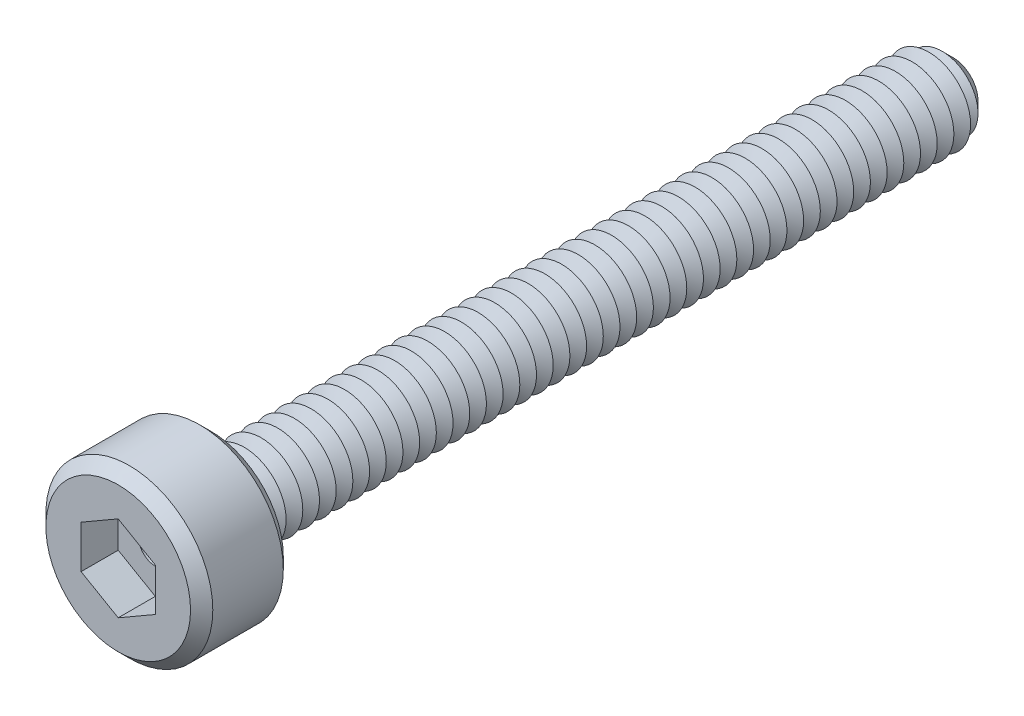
ISO-10303-21;
HEADER;
FILE_DESCRIPTION(('STEP AP214'),'2;1');
FILE_NAME('part.step','',(''),(''),'','','');
FILE_SCHEMA(('AUTOMOTIVE_DESIGN { 1 0 10303 214 1 1 1 1 }'));
ENDSEC;
DATA;
#1=APPLICATION_CONTEXT('core data for automotive mechanical design processes');
#2=APPLICATION_PROTOCOL_DEFINITION('international standard','automotive_design',2000,#1);
#3=PRODUCT_CONTEXT('',#1,'mechanical');
#4=PRODUCT('Part','Part','',(#3));
#5=PRODUCT_RELATED_PRODUCT_CATEGORY('part','',(#4));
#6=PRODUCT_DEFINITION_FORMATION('','',#4);
#7=PRODUCT_DEFINITION_CONTEXT('part definition',#1,'design');
#8=PRODUCT_DEFINITION('design','',#6,#7);
#9=PRODUCT_DEFINITION_SHAPE('','',#8);
#10=(LENGTH_UNIT() NAMED_UNIT(*) SI_UNIT(.MILLI.,.METRE.));
#11=(NAMED_UNIT(*) PLANE_ANGLE_UNIT() SI_UNIT($,.RADIAN.));
#12=(NAMED_UNIT(*) SI_UNIT($,.STERADIAN.) SOLID_ANGLE_UNIT());
#13=UNCERTAINTY_MEASURE_WITH_UNIT(LENGTH_MEASURE(1.E-05),#10,'distance_accuracy_value','');
#14=(GEOMETRIC_REPRESENTATION_CONTEXT(3) GLOBAL_UNCERTAINTY_ASSIGNED_CONTEXT((#13)) GLOBAL_UNIT_ASSIGNED_CONTEXT((#10,
#11,#12)) REPRESENTATION_CONTEXT('',''));
#15=CARTESIAN_POINT('',(0.,0.,0.));
#16=DIRECTION('',(0.,0.,1.));
#17=DIRECTION('',(1.,0.,0.));
#18=AXIS2_PLACEMENT_3D('',#15,#16,#17);
#19=CARTESIAN_POINT('',(0.,0.,2.5));
#20=DIRECTION('',(0.,0.,-1.));
#21=DIRECTION('',(-1.,0.,0.));
#22=AXIS2_PLACEMENT_3D('',#19,#20,#21);
#23=CYLINDRICAL_SURFACE('',#22,2.25);
#24=CARTESIAN_POINT('',(0.,0.,0.300000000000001));
#25=DIRECTION('',(0.,0.,1.));
#26=DIRECTION('',(1.,0.,0.));
#27=AXIS2_PLACEMENT_3D('',#24,#25,#26);
#28=CIRCLE('',#27,2.25);
#29=CARTESIAN_POINT('',(2.25,0.,0.300000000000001));
#30=VERTEX_POINT('',#29);
#31=EDGE_CURVE('E528',#30,#30,#28,.T.);
#32=ORIENTED_EDGE('',*,*,#31,.T.);
#33=EDGE_LOOP('',(#32));
#34=FACE_BOUND('',#33,.T.);
#35=CARTESIAN_POINT('',(0.,0.,2.2));
#36=DIRECTION('',(0.,0.,1.));
#37=DIRECTION('',(1.,0.,0.));
#38=AXIS2_PLACEMENT_3D('',#35,#36,#37);
#39=CIRCLE('',#38,2.25);
#40=CARTESIAN_POINT('',(2.25,0.,2.2));
#41=VERTEX_POINT('',#40);
#42=EDGE_CURVE('E521',#41,#41,#39,.F.);
#43=ORIENTED_EDGE('',*,*,#42,.T.);
#44=EDGE_LOOP('',(#43));
#45=FACE_BOUND('',#44,.T.);
#46=ADVANCED_FACE('F39',(#34,#45),#23,.T.);
#47=CARTESIAN_POINT('',(0.,0.,2.5));
#48=DIRECTION('',(0.,0.,1.));
#49=DIRECTION('',(1.,0.,0.));
#50=AXIS2_PLACEMENT_3D('',#47,#48,#49);
#51=PLANE('',#50);
#52=CARTESIAN_POINT('',(0.,0.,2.5));
#53=DIRECTION('',(0.,0.,1.));
#54=DIRECTION('',(1.,0.,0.));
#55=AXIS2_PLACEMENT_3D('',#52,#53,#54);
#56=CIRCLE('',#55,1.95);
#57=CARTESIAN_POINT('',(1.95,0.,2.5));
#58=VERTEX_POINT('',#57);
#59=EDGE_CURVE('E11',#58,#58,#56,.T.);
#60=ORIENTED_EDGE('',*,*,#59,.T.);
#61=EDGE_LOOP('',(#60));
#62=FACE_BOUND('',#61,.T.);
#63=DIRECTION('',(-0.866025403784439,0.5,0.));
#64=VECTOR('',#63,1.);
#65=CARTESIAN_POINT('',(0.999999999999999,0.577350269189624,2.5));
#66=LINE('',#65,#64);
#67=CARTESIAN_POINT('',(0.999999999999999,0.577350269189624,2.5));
#68=VERTEX_POINT('',#67);
#69=CARTESIAN_POINT('',(0.,1.15470053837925,2.5));
#70=VERTEX_POINT('',#69);
#71=EDGE_CURVE('E55',#68,#70,#66,.T.);
#72=ORIENTED_EDGE('',*,*,#71,.F.);
#73=DIRECTION('',(0.,1.,0.));
#74=VECTOR('',#73,1.);
#75=CARTESIAN_POINT('',(1.,-0.577350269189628,2.5));
#76=LINE('',#75,#74);
#77=CARTESIAN_POINT('',(1.,-0.577350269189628,2.5));
#78=VERTEX_POINT('',#77);
#79=EDGE_CURVE('E151',#78,#68,#76,.T.);
#80=ORIENTED_EDGE('',*,*,#79,.F.);
#81=DIRECTION('',(0.866025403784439,0.5,0.));
#82=VECTOR('',#81,1.);
#83=CARTESIAN_POINT('',(0.,-1.15470053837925,2.5));
#84=LINE('',#83,#82);
#85=CARTESIAN_POINT('',(0.,-1.15470053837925,2.5));
#86=VERTEX_POINT('',#85);
#87=EDGE_CURVE('E148',#86,#78,#84,.T.);
#88=ORIENTED_EDGE('',*,*,#87,.F.);
#89=DIRECTION('',(0.866025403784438,-0.5,0.));
#90=VECTOR('',#89,1.);
#91=CARTESIAN_POINT('',(-1.,-0.577350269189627,2.5));
#92=LINE('',#91,#90);
#93=CARTESIAN_POINT('',(-1.,-0.577350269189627,2.5));
#94=VERTEX_POINT('',#93);
#95=EDGE_CURVE('E103',#94,#86,#92,.T.);
#96=ORIENTED_EDGE('',*,*,#95,.F.);
#97=DIRECTION('',(0.,-1.,0.));
#98=VECTOR('',#97,1.);
#99=CARTESIAN_POINT('',(-1.,0.577350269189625,2.5));
#100=LINE('',#99,#98);
#101=CARTESIAN_POINT('',(-1.,0.577350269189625,2.5));
#102=VERTEX_POINT('',#101);
#103=EDGE_CURVE('E142',#102,#94,#100,.T.);
#104=ORIENTED_EDGE('',*,*,#103,.F.);
#105=DIRECTION('',(-0.866025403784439,-0.5,0.));
#106=VECTOR('',#105,1.);
#107=CARTESIAN_POINT('',(0.,1.15470053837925,2.5));
#108=LINE('',#107,#106);
#109=EDGE_CURVE('E137',#70,#102,#108,.T.);
#110=ORIENTED_EDGE('',*,*,#109,.F.);
#111=EDGE_LOOP('',(#72,#80,#88,#96,#104,#110));
#112=FACE_BOUND('',#111,.T.);
#113=ADVANCED_FACE('F546',(#62,#112),#51,.T.);
#114=CARTESIAN_POINT('',(0.,0.,0.));
#115=DIRECTION('',(0.,0.,1.));
#116=DIRECTION('',(1.,0.,0.));
#117=AXIS2_PLACEMENT_3D('',#114,#115,#116);
#118=PLANE('',#117);
#119=CARTESIAN_POINT('',(0.,0.,0.));
#120=DIRECTION('',(0.,0.,1.));
#121=DIRECTION('',(1.,0.,0.));
#122=AXIS2_PLACEMENT_3D('',#119,#120,#121);
#123=CIRCLE('',#122,1.95);
#124=CARTESIAN_POINT('',(1.95,0.,0.));
#125=VERTEX_POINT('',#124);
#126=EDGE_CURVE('E48',#125,#125,#123,.F.);
#127=ORIENTED_EDGE('',*,*,#126,.T.);
#128=EDGE_LOOP('',(#127));
#129=FACE_BOUND('',#128,.T.);
#130=CARTESIAN_POINT('',(0.,0.,0.));
#131=DIRECTION('',(0.,0.,1.));
#132=DIRECTION('',(1.,0.,0.));
#133=AXIS2_PLACEMENT_3D('',#130,#131,#132);
#134=CIRCLE('',#133,1.125);
#135=CARTESIAN_POINT('',(1.125,0.,0.));
#136=VERTEX_POINT('',#135);
#137=EDGE_CURVE('E513',#136,#136,#134,.T.);
#138=ORIENTED_EDGE('',*,*,#137,.T.);
#139=EDGE_LOOP('',(#138));
#140=FACE_BOUND('',#139,.T.);
#141=ADVANCED_FACE('F535',(#129,#140),#118,.F.);
#142=CARTESIAN_POINT('',(0.,0.,0.));
#143=DIRECTION('',(0.,0.,1.));
#144=DIRECTION('',(1.,0.,0.));
#145=AXIS2_PLACEMENT_3D('',#142,#143,#144);
#146=CONICAL_SURFACE('',#145,1.125,1.0471975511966);
#147=CARTESIAN_POINT('',(0.,0.,-0.225));
#148=DIRECTION('',(0.,0.,1.));
#149=DIRECTION('',(1.,0.,0.));
#150=AXIS2_PLACEMENT_3D('',#147,#148,#149);
#151=CIRCLE('',#150,0.735288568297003);
#152=CARTESIAN_POINT('',(0.735288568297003,0.,-0.225));
#153=VERTEX_POINT('',#152);
#154=EDGE_CURVE('E510',#153,#153,#151,.T.);
#155=ORIENTED_EDGE('',*,*,#154,.T.);
#156=EDGE_LOOP('',(#155));
#157=FACE_BOUND('',#156,.T.);
#158=ORIENTED_EDGE('',*,*,#137,.F.);
#159=EDGE_LOOP('',(#158));
#160=FACE_BOUND('',#159,.T.);
#161=ADVANCED_FACE('F948',(#157,#160),#146,.T.);
#162=CARTESIAN_POINT('',(0.,0.,-0.225));
#163=DIRECTION('',(0.,0.,-1.));
#164=DIRECTION('',(-1.,0.,0.));
#165=AXIS2_PLACEMENT_3D('',#162,#163,#164);
#166=CONICAL_SURFACE('',#165,0.735288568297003,1.0471975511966);
#167=CARTESIAN_POINT('',(0.,0.,-0.45));
#168=DIRECTION('',(0.,0.,1.));
#169=DIRECTION('',(1.,0.,0.));
#170=AXIS2_PLACEMENT_3D('',#167,#168,#169);
#171=CIRCLE('',#170,1.125);
#172=CARTESIAN_POINT('',(1.125,0.,-0.45));
#173=VERTEX_POINT('',#172);
#174=EDGE_CURVE('E506',#173,#173,#171,.T.);
#175=ORIENTED_EDGE('',*,*,#174,.T.);
#176=EDGE_LOOP('',(#175));
#177=FACE_BOUND('',#176,.T.);
#178=ORIENTED_EDGE('',*,*,#154,.F.);
#179=EDGE_LOOP('',(#178));
#180=FACE_BOUND('',#179,.T.);
#181=ADVANCED_FACE('F944',(#177,#180),#166,.T.);
#182=CARTESIAN_POINT('',(0.,0.,-0.45));
#183=DIRECTION('',(0.,0.,1.));
#184=DIRECTION('',(1.,0.,0.));
#185=AXIS2_PLACEMENT_3D('',#182,#183,#184);
#186=CONICAL_SURFACE('',#185,1.125,1.0471975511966);
#187=CARTESIAN_POINT('',(0.,0.,-0.675));
#188=DIRECTION('',(0.,0.,1.));
#189=DIRECTION('',(1.,0.,0.));
#190=AXIS2_PLACEMENT_3D('',#187,#188,#189);
#191=CIRCLE('',#190,0.735288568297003);
#192=CARTESIAN_POINT('',(0.735288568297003,0.,-0.675));
#193=VERTEX_POINT('',#192);
#194=EDGE_CURVE('E502',#193,#193,#191,.T.);
#195=ORIENTED_EDGE('',*,*,#194,.T.);
#196=EDGE_LOOP('',(#195));
#197=FACE_BOUND('',#196,.T.);
#198=ORIENTED_EDGE('',*,*,#174,.F.);
#199=EDGE_LOOP('',(#198));
#200=FACE_BOUND('',#199,.T.);
#201=ADVANCED_FACE('F940',(#197,#200),#186,.T.);
#202=CARTESIAN_POINT('',(0.,0.,-0.675));
#203=DIRECTION('',(0.,0.,-1.));
#204=DIRECTION('',(-1.,0.,0.));
#205=AXIS2_PLACEMENT_3D('',#202,#203,#204);
#206=CONICAL_SURFACE('',#205,0.735288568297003,1.0471975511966);
#207=CARTESIAN_POINT('',(0.,0.,-0.9));
#208=DIRECTION('',(0.,0.,1.));
#209=DIRECTION('',(1.,0.,0.));
#210=AXIS2_PLACEMENT_3D('',#207,#208,#209);
#211=CIRCLE('',#210,1.125);
#212=CARTESIAN_POINT('',(1.125,0.,-0.9));
#213=VERTEX_POINT('',#212);
#214=EDGE_CURVE('E498',#213,#213,#211,.T.);
#215=ORIENTED_EDGE('',*,*,#214,.T.);
#216=EDGE_LOOP('',(#215));
#217=FACE_BOUND('',#216,.T.);
#218=ORIENTED_EDGE('',*,*,#194,.F.);
#219=EDGE_LOOP('',(#218));
#220=FACE_BOUND('',#219,.T.);
#221=ADVANCED_FACE('F936',(#217,#220),#206,.T.);
#222=CARTESIAN_POINT('',(0.,0.,-0.9));
#223=DIRECTION('',(0.,0.,1.));
#224=DIRECTION('',(1.,0.,0.));
#225=AXIS2_PLACEMENT_3D('',#222,#223,#224);
#226=CONICAL_SURFACE('',#225,1.125,1.0471975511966);
#227=CARTESIAN_POINT('',(0.,0.,-1.125));
#228=DIRECTION('',(0.,0.,1.));
#229=DIRECTION('',(1.,0.,0.));
#230=AXIS2_PLACEMENT_3D('',#227,#228,#229);
#231=CIRCLE('',#230,0.735288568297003);
#232=CARTESIAN_POINT('',(0.735288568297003,0.,-1.125));
#233=VERTEX_POINT('',#232);
#234=EDGE_CURVE('E494',#233,#233,#231,.T.);
#235=ORIENTED_EDGE('',*,*,#234,.T.);
#236=EDGE_LOOP('',(#235));
#237=FACE_BOUND('',#236,.T.);
#238=ORIENTED_EDGE('',*,*,#214,.F.);
#239=EDGE_LOOP('',(#238));
#240=FACE_BOUND('',#239,.T.);
#241=ADVANCED_FACE('F932',(#237,#240),#226,.T.);
#242=CARTESIAN_POINT('',(0.,0.,-1.125));
#243=DIRECTION('',(0.,0.,-1.));
#244=DIRECTION('',(-1.,0.,0.));
#245=AXIS2_PLACEMENT_3D('',#242,#243,#244);
#246=CONICAL_SURFACE('',#245,0.735288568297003,1.0471975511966);
#247=CARTESIAN_POINT('',(0.,0.,-1.35));
#248=DIRECTION('',(0.,0.,1.));
#249=DIRECTION('',(1.,0.,0.));
#250=AXIS2_PLACEMENT_3D('',#247,#248,#249);
#251=CIRCLE('',#250,1.125);
#252=CARTESIAN_POINT('',(1.125,0.,-1.35));
#253=VERTEX_POINT('',#252);
#254=EDGE_CURVE('E490',#253,#253,#251,.T.);
#255=ORIENTED_EDGE('',*,*,#254,.T.);
#256=EDGE_LOOP('',(#255));
#257=FACE_BOUND('',#256,.T.);
#258=ORIENTED_EDGE('',*,*,#234,.F.);
#259=EDGE_LOOP('',(#258));
#260=FACE_BOUND('',#259,.T.);
#261=ADVANCED_FACE('F928',(#257,#260),#246,.T.);
#262=CARTESIAN_POINT('',(0.,0.,-1.35));
#263=DIRECTION('',(0.,0.,1.));
#264=DIRECTION('',(1.,0.,0.));
#265=AXIS2_PLACEMENT_3D('',#262,#263,#264);
#266=CONICAL_SURFACE('',#265,1.125,1.0471975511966);
#267=CARTESIAN_POINT('',(0.,0.,-1.575));
#268=DIRECTION('',(0.,0.,1.));
#269=DIRECTION('',(1.,0.,0.));
#270=AXIS2_PLACEMENT_3D('',#267,#268,#269);
#271=CIRCLE('',#270,0.735288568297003);
#272=CARTESIAN_POINT('',(0.735288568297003,0.,-1.575));
#273=VERTEX_POINT('',#272);
#274=EDGE_CURVE('E486',#273,#273,#271,.T.);
#275=ORIENTED_EDGE('',*,*,#274,.T.);
#276=EDGE_LOOP('',(#275));
#277=FACE_BOUND('',#276,.T.);
#278=ORIENTED_EDGE('',*,*,#254,.F.);
#279=EDGE_LOOP('',(#278));
#280=FACE_BOUND('',#279,.T.);
#281=ADVANCED_FACE('F924',(#277,#280),#266,.T.);
#282=CARTESIAN_POINT('',(0.,0.,-1.575));
#283=DIRECTION('',(0.,0.,-1.));
#284=DIRECTION('',(-1.,0.,0.));
#285=AXIS2_PLACEMENT_3D('',#282,#283,#284);
#286=CONICAL_SURFACE('',#285,0.735288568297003,1.0471975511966);
#287=CARTESIAN_POINT('',(0.,0.,-1.8));
#288=DIRECTION('',(0.,0.,1.));
#289=DIRECTION('',(1.,0.,0.));
#290=AXIS2_PLACEMENT_3D('',#287,#288,#289);
#291=CIRCLE('',#290,1.125);
#292=CARTESIAN_POINT('',(1.125,0.,-1.8));
#293=VERTEX_POINT('',#292);
#294=EDGE_CURVE('E482',#293,#293,#291,.T.);
#295=ORIENTED_EDGE('',*,*,#294,.T.);
#296=EDGE_LOOP('',(#295));
#297=FACE_BOUND('',#296,.T.);
#298=ORIENTED_EDGE('',*,*,#274,.F.);
#299=EDGE_LOOP('',(#298));
#300=FACE_BOUND('',#299,.T.);
#301=ADVANCED_FACE('F920',(#297,#300),#286,.T.);
#302=CARTESIAN_POINT('',(0.,0.,-1.8));
#303=DIRECTION('',(0.,0.,1.));
#304=DIRECTION('',(1.,0.,0.));
#305=AXIS2_PLACEMENT_3D('',#302,#303,#304);
#306=CONICAL_SURFACE('',#305,1.125,1.0471975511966);
#307=CARTESIAN_POINT('',(0.,0.,-2.025));
#308=DIRECTION('',(0.,0.,1.));
#309=DIRECTION('',(1.,0.,0.));
#310=AXIS2_PLACEMENT_3D('',#307,#308,#309);
#311=CIRCLE('',#310,0.735288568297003);
#312=CARTESIAN_POINT('',(0.735288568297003,0.,-2.025));
#313=VERTEX_POINT('',#312);
#314=EDGE_CURVE('E478',#313,#313,#311,.T.);
#315=ORIENTED_EDGE('',*,*,#314,.T.);
#316=EDGE_LOOP('',(#315));
#317=FACE_BOUND('',#316,.T.);
#318=ORIENTED_EDGE('',*,*,#294,.F.);
#319=EDGE_LOOP('',(#318));
#320=FACE_BOUND('',#319,.T.);
#321=ADVANCED_FACE('F916',(#317,#320),#306,.T.);
#322=CARTESIAN_POINT('',(0.,0.,-2.025));
#323=DIRECTION('',(0.,0.,-1.));
#324=DIRECTION('',(-1.,0.,0.));
#325=AXIS2_PLACEMENT_3D('',#322,#323,#324);
#326=CONICAL_SURFACE('',#325,0.735288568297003,1.0471975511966);
#327=CARTESIAN_POINT('',(0.,0.,-2.25));
#328=DIRECTION('',(0.,0.,1.));
#329=DIRECTION('',(1.,0.,0.));
#330=AXIS2_PLACEMENT_3D('',#327,#328,#329);
#331=CIRCLE('',#330,1.125);
#332=CARTESIAN_POINT('',(1.125,0.,-2.25));
#333=VERTEX_POINT('',#332);
#334=EDGE_CURVE('E474',#333,#333,#331,.T.);
#335=ORIENTED_EDGE('',*,*,#334,.T.);
#336=EDGE_LOOP('',(#335));
#337=FACE_BOUND('',#336,.T.);
#338=ORIENTED_EDGE('',*,*,#314,.F.);
#339=EDGE_LOOP('',(#338));
#340=FACE_BOUND('',#339,.T.);
#341=ADVANCED_FACE('F912',(#337,#340),#326,.T.);
#342=CARTESIAN_POINT('',(0.,0.,-2.25));
#343=DIRECTION('',(0.,0.,1.));
#344=DIRECTION('',(1.,0.,0.));
#345=AXIS2_PLACEMENT_3D('',#342,#343,#344);
#346=CONICAL_SURFACE('',#345,1.125,1.0471975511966);
#347=CARTESIAN_POINT('',(0.,0.,-2.475));
#348=DIRECTION('',(0.,0.,1.));
#349=DIRECTION('',(1.,0.,0.));
#350=AXIS2_PLACEMENT_3D('',#347,#348,#349);
#351=CIRCLE('',#350,0.735288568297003);
#352=CARTESIAN_POINT('',(0.735288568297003,0.,-2.475));
#353=VERTEX_POINT('',#352);
#354=EDGE_CURVE('E470',#353,#353,#351,.T.);
#355=ORIENTED_EDGE('',*,*,#354,.T.);
#356=EDGE_LOOP('',(#355));
#357=FACE_BOUND('',#356,.T.);
#358=ORIENTED_EDGE('',*,*,#334,.F.);
#359=EDGE_LOOP('',(#358));
#360=FACE_BOUND('',#359,.T.);
#361=ADVANCED_FACE('F908',(#357,#360),#346,.T.);
#362=CARTESIAN_POINT('',(0.,0.,-2.475));
#363=DIRECTION('',(0.,0.,-1.));
#364=DIRECTION('',(-1.,0.,0.));
#365=AXIS2_PLACEMENT_3D('',#362,#363,#364);
#366=CONICAL_SURFACE('',#365,0.735288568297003,1.0471975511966);
#367=CARTESIAN_POINT('',(0.,0.,-2.7));
#368=DIRECTION('',(0.,0.,1.));
#369=DIRECTION('',(1.,0.,0.));
#370=AXIS2_PLACEMENT_3D('',#367,#368,#369);
#371=CIRCLE('',#370,1.125);
#372=CARTESIAN_POINT('',(1.125,0.,-2.7));
#373=VERTEX_POINT('',#372);
#374=EDGE_CURVE('E466',#373,#373,#371,.T.);
#375=ORIENTED_EDGE('',*,*,#374,.T.);
#376=EDGE_LOOP('',(#375));
#377=FACE_BOUND('',#376,.T.);
#378=ORIENTED_EDGE('',*,*,#354,.F.);
#379=EDGE_LOOP('',(#378));
#380=FACE_BOUND('',#379,.T.);
#381=ADVANCED_FACE('F904',(#377,#380),#366,.T.);
#382=CARTESIAN_POINT('',(0.,0.,-2.7));
#383=DIRECTION('',(0.,0.,1.));
#384=DIRECTION('',(1.,0.,0.));
#385=AXIS2_PLACEMENT_3D('',#382,#383,#384);
#386=CONICAL_SURFACE('',#385,1.125,1.0471975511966);
#387=CARTESIAN_POINT('',(0.,0.,-2.925));
#388=DIRECTION('',(0.,0.,1.));
#389=DIRECTION('',(1.,0.,0.));
#390=AXIS2_PLACEMENT_3D('',#387,#388,#389);
#391=CIRCLE('',#390,0.735288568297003);
#392=CARTESIAN_POINT('',(0.735288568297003,0.,-2.925));
#393=VERTEX_POINT('',#392);
#394=EDGE_CURVE('E462',#393,#393,#391,.T.);
#395=ORIENTED_EDGE('',*,*,#394,.T.);
#396=EDGE_LOOP('',(#395));
#397=FACE_BOUND('',#396,.T.);
#398=ORIENTED_EDGE('',*,*,#374,.F.);
#399=EDGE_LOOP('',(#398));
#400=FACE_BOUND('',#399,.T.);
#401=ADVANCED_FACE('F900',(#397,#400),#386,.T.);
#402=CARTESIAN_POINT('',(0.,0.,-2.925));
#403=DIRECTION('',(0.,0.,-1.));
#404=DIRECTION('',(-1.,0.,0.));
#405=AXIS2_PLACEMENT_3D('',#402,#403,#404);
#406=CONICAL_SURFACE('',#405,0.735288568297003,1.0471975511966);
#407=CARTESIAN_POINT('',(0.,0.,-3.15));
#408=DIRECTION('',(0.,0.,1.));
#409=DIRECTION('',(1.,0.,0.));
#410=AXIS2_PLACEMENT_3D('',#407,#408,#409);
#411=CIRCLE('',#410,1.125);
#412=CARTESIAN_POINT('',(1.125,0.,-3.15));
#413=VERTEX_POINT('',#412);
#414=EDGE_CURVE('E458',#413,#413,#411,.T.);
#415=ORIENTED_EDGE('',*,*,#414,.T.);
#416=EDGE_LOOP('',(#415));
#417=FACE_BOUND('',#416,.T.);
#418=ORIENTED_EDGE('',*,*,#394,.F.);
#419=EDGE_LOOP('',(#418));
#420=FACE_BOUND('',#419,.T.);
#421=ADVANCED_FACE('F896',(#417,#420),#406,.T.);
#422=CARTESIAN_POINT('',(0.,0.,-3.15));
#423=DIRECTION('',(0.,0.,1.));
#424=DIRECTION('',(1.,0.,0.));
#425=AXIS2_PLACEMENT_3D('',#422,#423,#424);
#426=CONICAL_SURFACE('',#425,1.125,1.0471975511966);
#427=CARTESIAN_POINT('',(0.,0.,-3.375));
#428=DIRECTION('',(0.,0.,1.));
#429=DIRECTION('',(1.,0.,0.));
#430=AXIS2_PLACEMENT_3D('',#427,#428,#429);
#431=CIRCLE('',#430,0.735288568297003);
#432=CARTESIAN_POINT('',(0.735288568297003,0.,-3.375));
#433=VERTEX_POINT('',#432);
#434=EDGE_CURVE('E454',#433,#433,#431,.T.);
#435=ORIENTED_EDGE('',*,*,#434,.T.);
#436=EDGE_LOOP('',(#435));
#437=FACE_BOUND('',#436,.T.);
#438=ORIENTED_EDGE('',*,*,#414,.F.);
#439=EDGE_LOOP('',(#438));
#440=FACE_BOUND('',#439,.T.);
#441=ADVANCED_FACE('F892',(#437,#440),#426,.T.);
#442=CARTESIAN_POINT('',(0.,0.,-3.375));
#443=DIRECTION('',(0.,0.,-1.));
#444=DIRECTION('',(-1.,0.,0.));
#445=AXIS2_PLACEMENT_3D('',#442,#443,#444);
#446=CONICAL_SURFACE('',#445,0.735288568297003,1.0471975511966);
#447=CARTESIAN_POINT('',(0.,0.,-3.6));
#448=DIRECTION('',(0.,0.,1.));
#449=DIRECTION('',(1.,0.,0.));
#450=AXIS2_PLACEMENT_3D('',#447,#448,#449);
#451=CIRCLE('',#450,1.125);
#452=CARTESIAN_POINT('',(1.125,0.,-3.6));
#453=VERTEX_POINT('',#452);
#454=EDGE_CURVE('E450',#453,#453,#451,.T.);
#455=ORIENTED_EDGE('',*,*,#454,.T.);
#456=EDGE_LOOP('',(#455));
#457=FACE_BOUND('',#456,.T.);
#458=ORIENTED_EDGE('',*,*,#434,.F.);
#459=EDGE_LOOP('',(#458));
#460=FACE_BOUND('',#459,.T.);
#461=ADVANCED_FACE('F888',(#457,#460),#446,.T.);
#462=CARTESIAN_POINT('',(0.,0.,-3.6));
#463=DIRECTION('',(0.,0.,1.));
#464=DIRECTION('',(1.,0.,0.));
#465=AXIS2_PLACEMENT_3D('',#462,#463,#464);
#466=CONICAL_SURFACE('',#465,1.125,1.0471975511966);
#467=CARTESIAN_POINT('',(0.,0.,-3.825));
#468=DIRECTION('',(0.,0.,1.));
#469=DIRECTION('',(1.,0.,0.));
#470=AXIS2_PLACEMENT_3D('',#467,#468,#469);
#471=CIRCLE('',#470,0.735288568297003);
#472=CARTESIAN_POINT('',(0.735288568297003,0.,-3.825));
#473=VERTEX_POINT('',#472);
#474=EDGE_CURVE('E446',#473,#473,#471,.T.);
#475=ORIENTED_EDGE('',*,*,#474,.T.);
#476=EDGE_LOOP('',(#475));
#477=FACE_BOUND('',#476,.T.);
#478=ORIENTED_EDGE('',*,*,#454,.F.);
#479=EDGE_LOOP('',(#478));
#480=FACE_BOUND('',#479,.T.);
#481=ADVANCED_FACE('F884',(#477,#480),#466,.T.);
#482=CARTESIAN_POINT('',(0.,0.,-3.825));
#483=DIRECTION('',(0.,0.,-1.));
#484=DIRECTION('',(-1.,0.,0.));
#485=AXIS2_PLACEMENT_3D('',#482,#483,#484);
#486=CONICAL_SURFACE('',#485,0.735288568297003,1.0471975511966);
#487=CARTESIAN_POINT('',(0.,0.,-4.05));
#488=DIRECTION('',(0.,0.,1.));
#489=DIRECTION('',(1.,0.,0.));
#490=AXIS2_PLACEMENT_3D('',#487,#488,#489);
#491=CIRCLE('',#490,1.125);
#492=CARTESIAN_POINT('',(1.125,0.,-4.05));
#493=VERTEX_POINT('',#492);
#494=EDGE_CURVE('E442',#493,#493,#491,.T.);
#495=ORIENTED_EDGE('',*,*,#494,.T.);
#496=EDGE_LOOP('',(#495));
#497=FACE_BOUND('',#496,.T.);
#498=ORIENTED_EDGE('',*,*,#474,.F.);
#499=EDGE_LOOP('',(#498));
#500=FACE_BOUND('',#499,.T.);
#501=ADVANCED_FACE('F880',(#497,#500),#486,.T.);
#502=CARTESIAN_POINT('',(0.,0.,-4.05));
#503=DIRECTION('',(0.,0.,1.));
#504=DIRECTION('',(1.,0.,0.));
#505=AXIS2_PLACEMENT_3D('',#502,#503,#504);
#506=CONICAL_SURFACE('',#505,1.125,1.0471975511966);
#507=CARTESIAN_POINT('',(0.,0.,-4.275));
#508=DIRECTION('',(0.,0.,1.));
#509=DIRECTION('',(1.,0.,0.));
#510=AXIS2_PLACEMENT_3D('',#507,#508,#509);
#511=CIRCLE('',#510,0.735288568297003);
#512=CARTESIAN_POINT('',(0.735288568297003,0.,-4.275));
#513=VERTEX_POINT('',#512);
#514=EDGE_CURVE('E438',#513,#513,#511,.T.);
#515=ORIENTED_EDGE('',*,*,#514,.T.);
#516=EDGE_LOOP('',(#515));
#517=FACE_BOUND('',#516,.T.);
#518=ORIENTED_EDGE('',*,*,#494,.F.);
#519=EDGE_LOOP('',(#518));
#520=FACE_BOUND('',#519,.T.);
#521=ADVANCED_FACE('F876',(#517,#520),#506,.T.);
#522=CARTESIAN_POINT('',(0.,0.,-4.275));
#523=DIRECTION('',(0.,0.,-1.));
#524=DIRECTION('',(-1.,0.,0.));
#525=AXIS2_PLACEMENT_3D('',#522,#523,#524);
#526=CONICAL_SURFACE('',#525,0.735288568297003,1.0471975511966);
#527=CARTESIAN_POINT('',(0.,0.,-4.5));
#528=DIRECTION('',(0.,0.,1.));
#529=DIRECTION('',(1.,0.,0.));
#530=AXIS2_PLACEMENT_3D('',#527,#528,#529);
#531=CIRCLE('',#530,1.125);
#532=CARTESIAN_POINT('',(1.125,0.,-4.5));
#533=VERTEX_POINT('',#532);
#534=EDGE_CURVE('E434',#533,#533,#531,.T.);
#535=ORIENTED_EDGE('',*,*,#534,.T.);
#536=EDGE_LOOP('',(#535));
#537=FACE_BOUND('',#536,.T.);
#538=ORIENTED_EDGE('',*,*,#514,.F.);
#539=EDGE_LOOP('',(#538));
#540=FACE_BOUND('',#539,.T.);
#541=ADVANCED_FACE('F872',(#537,#540),#526,.T.);
#542=CARTESIAN_POINT('',(0.,0.,-4.5));
#543=DIRECTION('',(0.,0.,1.));
#544=DIRECTION('',(1.,0.,0.));
#545=AXIS2_PLACEMENT_3D('',#542,#543,#544);
#546=CONICAL_SURFACE('',#545,1.125,1.0471975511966);
#547=CARTESIAN_POINT('',(0.,0.,-4.725));
#548=DIRECTION('',(0.,0.,1.));
#549=DIRECTION('',(1.,0.,0.));
#550=AXIS2_PLACEMENT_3D('',#547,#548,#549);
#551=CIRCLE('',#550,0.735288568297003);
#552=CARTESIAN_POINT('',(0.735288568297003,0.,-4.725));
#553=VERTEX_POINT('',#552);
#554=EDGE_CURVE('E430',#553,#553,#551,.T.);
#555=ORIENTED_EDGE('',*,*,#554,.T.);
#556=EDGE_LOOP('',(#555));
#557=FACE_BOUND('',#556,.T.);
#558=ORIENTED_EDGE('',*,*,#534,.F.);
#559=EDGE_LOOP('',(#558));
#560=FACE_BOUND('',#559,.T.);
#561=ADVANCED_FACE('F868',(#557,#560),#546,.T.);
#562=CARTESIAN_POINT('',(0.,0.,-4.725));
#563=DIRECTION('',(0.,0.,-1.));
#564=DIRECTION('',(-1.,0.,0.));
#565=AXIS2_PLACEMENT_3D('',#562,#563,#564);
#566=CONICAL_SURFACE('',#565,0.735288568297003,1.0471975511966);
#567=CARTESIAN_POINT('',(0.,0.,-4.95));
#568=DIRECTION('',(0.,0.,1.));
#569=DIRECTION('',(1.,0.,0.));
#570=AXIS2_PLACEMENT_3D('',#567,#568,#569);
#571=CIRCLE('',#570,1.125);
#572=CARTESIAN_POINT('',(1.125,0.,-4.95));
#573=VERTEX_POINT('',#572);
#574=EDGE_CURVE('E426',#573,#573,#571,.T.);
#575=ORIENTED_EDGE('',*,*,#574,.T.);
#576=EDGE_LOOP('',(#575));
#577=FACE_BOUND('',#576,.T.);
#578=ORIENTED_EDGE('',*,*,#554,.F.);
#579=EDGE_LOOP('',(#578));
#580=FACE_BOUND('',#579,.T.);
#581=ADVANCED_FACE('F864',(#577,#580),#566,.T.);
#582=CARTESIAN_POINT('',(0.,0.,-4.95));
#583=DIRECTION('',(0.,0.,1.));
#584=DIRECTION('',(1.,0.,0.));
#585=AXIS2_PLACEMENT_3D('',#582,#583,#584);
#586=CONICAL_SURFACE('',#585,1.125,1.0471975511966);
#587=CARTESIAN_POINT('',(0.,0.,-5.175));
#588=DIRECTION('',(0.,0.,1.));
#589=DIRECTION('',(1.,0.,0.));
#590=AXIS2_PLACEMENT_3D('',#587,#588,#589);
#591=CIRCLE('',#590,0.735288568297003);
#592=CARTESIAN_POINT('',(0.735288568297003,0.,-5.175));
#593=VERTEX_POINT('',#592);
#594=EDGE_CURVE('E422',#593,#593,#591,.T.);
#595=ORIENTED_EDGE('',*,*,#594,.T.);
#596=EDGE_LOOP('',(#595));
#597=FACE_BOUND('',#596,.T.);
#598=ORIENTED_EDGE('',*,*,#574,.F.);
#599=EDGE_LOOP('',(#598));
#600=FACE_BOUND('',#599,.T.);
#601=ADVANCED_FACE('F860',(#597,#600),#586,.T.);
#602=CARTESIAN_POINT('',(0.,0.,-5.175));
#603=DIRECTION('',(0.,0.,-1.));
#604=DIRECTION('',(-1.,0.,0.));
#605=AXIS2_PLACEMENT_3D('',#602,#603,#604);
#606=CONICAL_SURFACE('',#605,0.735288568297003,1.0471975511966);
#607=CARTESIAN_POINT('',(0.,0.,-5.4));
#608=DIRECTION('',(0.,0.,1.));
#609=DIRECTION('',(1.,0.,0.));
#610=AXIS2_PLACEMENT_3D('',#607,#608,#609);
#611=CIRCLE('',#610,1.125);
#612=CARTESIAN_POINT('',(1.125,0.,-5.4));
#613=VERTEX_POINT('',#612);
#614=EDGE_CURVE('E418',#613,#613,#611,.T.);
#615=ORIENTED_EDGE('',*,*,#614,.T.);
#616=EDGE_LOOP('',(#615));
#617=FACE_BOUND('',#616,.T.);
#618=ORIENTED_EDGE('',*,*,#594,.F.);
#619=EDGE_LOOP('',(#618));
#620=FACE_BOUND('',#619,.T.);
#621=ADVANCED_FACE('F856',(#617,#620),#606,.T.);
#622=CARTESIAN_POINT('',(0.,0.,-5.4));
#623=DIRECTION('',(0.,0.,1.));
#624=DIRECTION('',(1.,0.,0.));
#625=AXIS2_PLACEMENT_3D('',#622,#623,#624);
#626=CONICAL_SURFACE('',#625,1.125,1.0471975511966);
#627=CARTESIAN_POINT('',(0.,0.,-5.625));
#628=DIRECTION('',(0.,0.,1.));
#629=DIRECTION('',(1.,0.,0.));
#630=AXIS2_PLACEMENT_3D('',#627,#628,#629);
#631=CIRCLE('',#630,0.735288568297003);
#632=CARTESIAN_POINT('',(0.735288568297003,0.,-5.625));
#633=VERTEX_POINT('',#632);
#634=EDGE_CURVE('E414',#633,#633,#631,.T.);
#635=ORIENTED_EDGE('',*,*,#634,.T.);
#636=EDGE_LOOP('',(#635));
#637=FACE_BOUND('',#636,.T.);
#638=ORIENTED_EDGE('',*,*,#614,.F.);
#639=EDGE_LOOP('',(#638));
#640=FACE_BOUND('',#639,.T.);
#641=ADVANCED_FACE('F852',(#637,#640),#626,.T.);
#642=CARTESIAN_POINT('',(0.,0.,-5.625));
#643=DIRECTION('',(0.,0.,-1.));
#644=DIRECTION('',(-1.,0.,0.));
#645=AXIS2_PLACEMENT_3D('',#642,#643,#644);
#646=CONICAL_SURFACE('',#645,0.735288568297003,1.0471975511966);
#647=CARTESIAN_POINT('',(0.,0.,-5.85));
#648=DIRECTION('',(0.,0.,1.));
#649=DIRECTION('',(1.,0.,0.));
#650=AXIS2_PLACEMENT_3D('',#647,#648,#649);
#651=CIRCLE('',#650,1.125);
#652=CARTESIAN_POINT('',(1.125,0.,-5.85));
#653=VERTEX_POINT('',#652);
#654=EDGE_CURVE('E410',#653,#653,#651,.T.);
#655=ORIENTED_EDGE('',*,*,#654,.T.);
#656=EDGE_LOOP('',(#655));
#657=FACE_BOUND('',#656,.T.);
#658=ORIENTED_EDGE('',*,*,#634,.F.);
#659=EDGE_LOOP('',(#658));
#660=FACE_BOUND('',#659,.T.);
#661=ADVANCED_FACE('F848',(#657,#660),#646,.T.);
#662=CARTESIAN_POINT('',(0.,0.,-5.85));
#663=DIRECTION('',(0.,0.,1.));
#664=DIRECTION('',(1.,0.,0.));
#665=AXIS2_PLACEMENT_3D('',#662,#663,#664);
#666=CONICAL_SURFACE('',#665,1.125,1.0471975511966);
#667=CARTESIAN_POINT('',(0.,0.,-6.075));
#668=DIRECTION('',(0.,0.,1.));
#669=DIRECTION('',(1.,0.,0.));
#670=AXIS2_PLACEMENT_3D('',#667,#668,#669);
#671=CIRCLE('',#670,0.735288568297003);
#672=CARTESIAN_POINT('',(0.735288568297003,0.,-6.075));
#673=VERTEX_POINT('',#672);
#674=EDGE_CURVE('E406',#673,#673,#671,.T.);
#675=ORIENTED_EDGE('',*,*,#674,.T.);
#676=EDGE_LOOP('',(#675));
#677=FACE_BOUND('',#676,.T.);
#678=ORIENTED_EDGE('',*,*,#654,.F.);
#679=EDGE_LOOP('',(#678));
#680=FACE_BOUND('',#679,.T.);
#681=ADVANCED_FACE('F844',(#677,#680),#666,.T.);
#682=CARTESIAN_POINT('',(0.,0.,-6.075));
#683=DIRECTION('',(0.,0.,-1.));
#684=DIRECTION('',(-1.,0.,0.));
#685=AXIS2_PLACEMENT_3D('',#682,#683,#684);
#686=CONICAL_SURFACE('',#685,0.735288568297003,1.0471975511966);
#687=CARTESIAN_POINT('',(0.,0.,-6.3));
#688=DIRECTION('',(0.,0.,1.));
#689=DIRECTION('',(1.,0.,0.));
#690=AXIS2_PLACEMENT_3D('',#687,#688,#689);
#691=CIRCLE('',#690,1.125);
#692=CARTESIAN_POINT('',(1.125,0.,-6.3));
#693=VERTEX_POINT('',#692);
#694=EDGE_CURVE('E402',#693,#693,#691,.T.);
#695=ORIENTED_EDGE('',*,*,#694,.T.);
#696=EDGE_LOOP('',(#695));
#697=FACE_BOUND('',#696,.T.);
#698=ORIENTED_EDGE('',*,*,#674,.F.);
#699=EDGE_LOOP('',(#698));
#700=FACE_BOUND('',#699,.T.);
#701=ADVANCED_FACE('F840',(#697,#700),#686,.T.);
#702=CARTESIAN_POINT('',(0.,0.,-6.3));
#703=DIRECTION('',(0.,0.,1.));
#704=DIRECTION('',(1.,0.,0.));
#705=AXIS2_PLACEMENT_3D('',#702,#703,#704);
#706=CONICAL_SURFACE('',#705,1.125,1.0471975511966);
#707=CARTESIAN_POINT('',(0.,0.,-6.525));
#708=DIRECTION('',(0.,0.,1.));
#709=DIRECTION('',(1.,0.,0.));
#710=AXIS2_PLACEMENT_3D('',#707,#708,#709);
#711=CIRCLE('',#710,0.735288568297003);
#712=CARTESIAN_POINT('',(0.735288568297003,0.,-6.525));
#713=VERTEX_POINT('',#712);
#714=EDGE_CURVE('E398',#713,#713,#711,.T.);
#715=ORIENTED_EDGE('',*,*,#714,.T.);
#716=EDGE_LOOP('',(#715));
#717=FACE_BOUND('',#716,.T.);
#718=ORIENTED_EDGE('',*,*,#694,.F.);
#719=EDGE_LOOP('',(#718));
#720=FACE_BOUND('',#719,.T.);
#721=ADVANCED_FACE('F836',(#717,#720),#706,.T.);
#722=CARTESIAN_POINT('',(0.,0.,-6.525));
#723=DIRECTION('',(0.,0.,-1.));
#724=DIRECTION('',(-1.,0.,0.));
#725=AXIS2_PLACEMENT_3D('',#722,#723,#724);
#726=CONICAL_SURFACE('',#725,0.735288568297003,1.0471975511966);
#727=CARTESIAN_POINT('',(0.,0.,-6.75));
#728=DIRECTION('',(0.,0.,1.));
#729=DIRECTION('',(1.,0.,0.));
#730=AXIS2_PLACEMENT_3D('',#727,#728,#729);
#731=CIRCLE('',#730,1.125);
#732=CARTESIAN_POINT('',(1.125,0.,-6.75));
#733=VERTEX_POINT('',#732);
#734=EDGE_CURVE('E394',#733,#733,#731,.T.);
#735=ORIENTED_EDGE('',*,*,#734,.T.);
#736=EDGE_LOOP('',(#735));
#737=FACE_BOUND('',#736,.T.);
#738=ORIENTED_EDGE('',*,*,#714,.F.);
#739=EDGE_LOOP('',(#738));
#740=FACE_BOUND('',#739,.T.);
#741=ADVANCED_FACE('F832',(#737,#740),#726,.T.);
#742=CARTESIAN_POINT('',(0.,0.,-6.75));
#743=DIRECTION('',(0.,0.,1.));
#744=DIRECTION('',(1.,0.,0.));
#745=AXIS2_PLACEMENT_3D('',#742,#743,#744);
#746=CONICAL_SURFACE('',#745,1.125,1.0471975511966);
#747=CARTESIAN_POINT('',(0.,0.,-6.975));
#748=DIRECTION('',(0.,0.,1.));
#749=DIRECTION('',(1.,0.,0.));
#750=AXIS2_PLACEMENT_3D('',#747,#748,#749);
#751=CIRCLE('',#750,0.735288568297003);
#752=CARTESIAN_POINT('',(0.735288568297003,0.,-6.975));
#753=VERTEX_POINT('',#752);
#754=EDGE_CURVE('E390',#753,#753,#751,.T.);
#755=ORIENTED_EDGE('',*,*,#754,.T.);
#756=EDGE_LOOP('',(#755));
#757=FACE_BOUND('',#756,.T.);
#758=ORIENTED_EDGE('',*,*,#734,.F.);
#759=EDGE_LOOP('',(#758));
#760=FACE_BOUND('',#759,.T.);
#761=ADVANCED_FACE('F828',(#757,#760),#746,.T.);
#762=CARTESIAN_POINT('',(0.,0.,-6.975));
#763=DIRECTION('',(0.,0.,-1.));
#764=DIRECTION('',(-1.,0.,0.));
#765=AXIS2_PLACEMENT_3D('',#762,#763,#764);
#766=CONICAL_SURFACE('',#765,0.735288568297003,1.0471975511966);
#767=CARTESIAN_POINT('',(0.,0.,-7.2));
#768=DIRECTION('',(0.,0.,1.));
#769=DIRECTION('',(1.,0.,0.));
#770=AXIS2_PLACEMENT_3D('',#767,#768,#769);
#771=CIRCLE('',#770,1.125);
#772=CARTESIAN_POINT('',(1.125,0.,-7.2));
#773=VERTEX_POINT('',#772);
#774=EDGE_CURVE('E386',#773,#773,#771,.T.);
#775=ORIENTED_EDGE('',*,*,#774,.T.);
#776=EDGE_LOOP('',(#775));
#777=FACE_BOUND('',#776,.T.);
#778=ORIENTED_EDGE('',*,*,#754,.F.);
#779=EDGE_LOOP('',(#778));
#780=FACE_BOUND('',#779,.T.);
#781=ADVANCED_FACE('F824',(#777,#780),#766,.T.);
#782=CARTESIAN_POINT('',(0.,0.,-7.2));
#783=DIRECTION('',(0.,0.,1.));
#784=DIRECTION('',(1.,0.,0.));
#785=AXIS2_PLACEMENT_3D('',#782,#783,#784);
#786=CONICAL_SURFACE('',#785,1.125,1.0471975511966);
#787=CARTESIAN_POINT('',(0.,0.,-7.425));
#788=DIRECTION('',(0.,0.,1.));
#789=DIRECTION('',(1.,0.,0.));
#790=AXIS2_PLACEMENT_3D('',#787,#788,#789);
#791=CIRCLE('',#790,0.735288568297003);
#792=CARTESIAN_POINT('',(0.735288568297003,0.,-7.425));
#793=VERTEX_POINT('',#792);
#794=EDGE_CURVE('E382',#793,#793,#791,.T.);
#795=ORIENTED_EDGE('',*,*,#794,.T.);
#796=EDGE_LOOP('',(#795));
#797=FACE_BOUND('',#796,.T.);
#798=ORIENTED_EDGE('',*,*,#774,.F.);
#799=EDGE_LOOP('',(#798));
#800=FACE_BOUND('',#799,.T.);
#801=ADVANCED_FACE('F820',(#797,#800),#786,.T.);
#802=CARTESIAN_POINT('',(0.,0.,-7.425));
#803=DIRECTION('',(0.,0.,-1.));
#804=DIRECTION('',(-1.,0.,0.));
#805=AXIS2_PLACEMENT_3D('',#802,#803,#804);
#806=CONICAL_SURFACE('',#805,0.735288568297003,1.0471975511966);
#807=CARTESIAN_POINT('',(0.,0.,-7.65));
#808=DIRECTION('',(0.,0.,1.));
#809=DIRECTION('',(1.,0.,0.));
#810=AXIS2_PLACEMENT_3D('',#807,#808,#809);
#811=CIRCLE('',#810,1.125);
#812=CARTESIAN_POINT('',(1.125,0.,-7.65));
#813=VERTEX_POINT('',#812);
#814=EDGE_CURVE('E378',#813,#813,#811,.T.);
#815=ORIENTED_EDGE('',*,*,#814,.T.);
#816=EDGE_LOOP('',(#815));
#817=FACE_BOUND('',#816,.T.);
#818=ORIENTED_EDGE('',*,*,#794,.F.);
#819=EDGE_LOOP('',(#818));
#820=FACE_BOUND('',#819,.T.);
#821=ADVANCED_FACE('F816',(#817,#820),#806,.T.);
#822=CARTESIAN_POINT('',(0.,0.,-7.65));
#823=DIRECTION('',(0.,0.,1.));
#824=DIRECTION('',(1.,0.,0.));
#825=AXIS2_PLACEMENT_3D('',#822,#823,#824);
#826=CONICAL_SURFACE('',#825,1.125,1.0471975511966);
#827=CARTESIAN_POINT('',(0.,0.,-7.875));
#828=DIRECTION('',(0.,0.,1.));
#829=DIRECTION('',(1.,0.,0.));
#830=AXIS2_PLACEMENT_3D('',#827,#828,#829);
#831=CIRCLE('',#830,0.735288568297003);
#832=CARTESIAN_POINT('',(0.735288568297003,0.,-7.875));
#833=VERTEX_POINT('',#832);
#834=EDGE_CURVE('E374',#833,#833,#831,.T.);
#835=ORIENTED_EDGE('',*,*,#834,.T.);
#836=EDGE_LOOP('',(#835));
#837=FACE_BOUND('',#836,.T.);
#838=ORIENTED_EDGE('',*,*,#814,.F.);
#839=EDGE_LOOP('',(#838));
#840=FACE_BOUND('',#839,.T.);
#841=ADVANCED_FACE('F812',(#837,#840),#826,.T.);
#842=CARTESIAN_POINT('',(0.,0.,-7.875));
#843=DIRECTION('',(0.,0.,-1.));
#844=DIRECTION('',(-1.,0.,0.));
#845=AXIS2_PLACEMENT_3D('',#842,#843,#844);
#846=CONICAL_SURFACE('',#845,0.735288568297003,1.0471975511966);
#847=CARTESIAN_POINT('',(0.,0.,-8.1));
#848=DIRECTION('',(0.,0.,1.));
#849=DIRECTION('',(1.,0.,0.));
#850=AXIS2_PLACEMENT_3D('',#847,#848,#849);
#851=CIRCLE('',#850,1.125);
#852=CARTESIAN_POINT('',(1.125,0.,-8.1));
#853=VERTEX_POINT('',#852);
#854=EDGE_CURVE('E370',#853,#853,#851,.T.);
#855=ORIENTED_EDGE('',*,*,#854,.T.);
#856=EDGE_LOOP('',(#855));
#857=FACE_BOUND('',#856,.T.);
#858=ORIENTED_EDGE('',*,*,#834,.F.);
#859=EDGE_LOOP('',(#858));
#860=FACE_BOUND('',#859,.T.);
#861=ADVANCED_FACE('F808',(#857,#860),#846,.T.);
#862=CARTESIAN_POINT('',(0.,0.,-8.1));
#863=DIRECTION('',(0.,0.,1.));
#864=DIRECTION('',(1.,0.,0.));
#865=AXIS2_PLACEMENT_3D('',#862,#863,#864);
#866=CONICAL_SURFACE('',#865,1.125,1.0471975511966);
#867=CARTESIAN_POINT('',(0.,0.,-8.325));
#868=DIRECTION('',(0.,0.,1.));
#869=DIRECTION('',(1.,0.,0.));
#870=AXIS2_PLACEMENT_3D('',#867,#868,#869);
#871=CIRCLE('',#870,0.735288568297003);
#872=CARTESIAN_POINT('',(0.735288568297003,0.,-8.325));
#873=VERTEX_POINT('',#872);
#874=EDGE_CURVE('E366',#873,#873,#871,.T.);
#875=ORIENTED_EDGE('',*,*,#874,.T.);
#876=EDGE_LOOP('',(#875));
#877=FACE_BOUND('',#876,.T.);
#878=ORIENTED_EDGE('',*,*,#854,.F.);
#879=EDGE_LOOP('',(#878));
#880=FACE_BOUND('',#879,.T.);
#881=ADVANCED_FACE('F804',(#877,#880),#866,.T.);
#882=CARTESIAN_POINT('',(0.,0.,-8.325));
#883=DIRECTION('',(0.,0.,-1.));
#884=DIRECTION('',(-1.,0.,0.));
#885=AXIS2_PLACEMENT_3D('',#882,#883,#884);
#886=CONICAL_SURFACE('',#885,0.735288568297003,1.0471975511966);
#887=CARTESIAN_POINT('',(0.,0.,-8.55));
#888=DIRECTION('',(0.,0.,1.));
#889=DIRECTION('',(1.,0.,0.));
#890=AXIS2_PLACEMENT_3D('',#887,#888,#889);
#891=CIRCLE('',#890,1.125);
#892=CARTESIAN_POINT('',(1.125,0.,-8.55));
#893=VERTEX_POINT('',#892);
#894=EDGE_CURVE('E362',#893,#893,#891,.T.);
#895=ORIENTED_EDGE('',*,*,#894,.T.);
#896=EDGE_LOOP('',(#895));
#897=FACE_BOUND('',#896,.T.);
#898=ORIENTED_EDGE('',*,*,#874,.F.);
#899=EDGE_LOOP('',(#898));
#900=FACE_BOUND('',#899,.T.);
#901=ADVANCED_FACE('F800',(#897,#900),#886,.T.);
#902=CARTESIAN_POINT('',(0.,0.,-8.55));
#903=DIRECTION('',(0.,0.,1.));
#904=DIRECTION('',(1.,0.,0.));
#905=AXIS2_PLACEMENT_3D('',#902,#903,#904);
#906=CONICAL_SURFACE('',#905,1.125,1.0471975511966);
#907=CARTESIAN_POINT('',(0.,0.,-8.775));
#908=DIRECTION('',(0.,0.,1.));
#909=DIRECTION('',(1.,0.,0.));
#910=AXIS2_PLACEMENT_3D('',#907,#908,#909);
#911=CIRCLE('',#910,0.735288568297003);
#912=CARTESIAN_POINT('',(0.735288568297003,0.,-8.775));
#913=VERTEX_POINT('',#912);
#914=EDGE_CURVE('E358',#913,#913,#911,.T.);
#915=ORIENTED_EDGE('',*,*,#914,.T.);
#916=EDGE_LOOP('',(#915));
#917=FACE_BOUND('',#916,.T.);
#918=ORIENTED_EDGE('',*,*,#894,.F.);
#919=EDGE_LOOP('',(#918));
#920=FACE_BOUND('',#919,.T.);
#921=ADVANCED_FACE('F796',(#917,#920),#906,.T.);
#922=CARTESIAN_POINT('',(0.,0.,-8.775));
#923=DIRECTION('',(0.,0.,-1.));
#924=DIRECTION('',(-1.,0.,0.));
#925=AXIS2_PLACEMENT_3D('',#922,#923,#924);
#926=CONICAL_SURFACE('',#925,0.735288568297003,1.0471975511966);
#927=CARTESIAN_POINT('',(0.,0.,-9.));
#928=DIRECTION('',(0.,0.,1.));
#929=DIRECTION('',(1.,0.,0.));
#930=AXIS2_PLACEMENT_3D('',#927,#928,#929);
#931=CIRCLE('',#930,1.125);
#932=CARTESIAN_POINT('',(1.125,0.,-9.));
#933=VERTEX_POINT('',#932);
#934=EDGE_CURVE('E354',#933,#933,#931,.T.);
#935=ORIENTED_EDGE('',*,*,#934,.T.);
#936=EDGE_LOOP('',(#935));
#937=FACE_BOUND('',#936,.T.);
#938=ORIENTED_EDGE('',*,*,#914,.F.);
#939=EDGE_LOOP('',(#938));
#940=FACE_BOUND('',#939,.T.);
#941=ADVANCED_FACE('F792',(#937,#940),#926,.T.);
#942=CARTESIAN_POINT('',(0.,0.,-9.));
#943=DIRECTION('',(0.,0.,1.));
#944=DIRECTION('',(1.,0.,0.));
#945=AXIS2_PLACEMENT_3D('',#942,#943,#944);
#946=CONICAL_SURFACE('',#945,1.125,1.0471975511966);
#947=CARTESIAN_POINT('',(0.,0.,-9.225));
#948=DIRECTION('',(0.,0.,1.));
#949=DIRECTION('',(1.,0.,0.));
#950=AXIS2_PLACEMENT_3D('',#947,#948,#949);
#951=CIRCLE('',#950,0.735288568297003);
#952=CARTESIAN_POINT('',(0.735288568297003,0.,-9.225));
#953=VERTEX_POINT('',#952);
#954=EDGE_CURVE('E350',#953,#953,#951,.T.);
#955=ORIENTED_EDGE('',*,*,#954,.T.);
#956=EDGE_LOOP('',(#955));
#957=FACE_BOUND('',#956,.T.);
#958=ORIENTED_EDGE('',*,*,#934,.F.);
#959=EDGE_LOOP('',(#958));
#960=FACE_BOUND('',#959,.T.);
#961=ADVANCED_FACE('F788',(#957,#960),#946,.T.);
#962=CARTESIAN_POINT('',(0.,0.,-9.225));
#963=DIRECTION('',(0.,0.,-1.));
#964=DIRECTION('',(-1.,0.,0.));
#965=AXIS2_PLACEMENT_3D('',#962,#963,#964);
#966=CONICAL_SURFACE('',#965,0.735288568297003,1.0471975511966);
#967=CARTESIAN_POINT('',(0.,0.,-9.45));
#968=DIRECTION('',(0.,0.,1.));
#969=DIRECTION('',(1.,0.,0.));
#970=AXIS2_PLACEMENT_3D('',#967,#968,#969);
#971=CIRCLE('',#970,1.125);
#972=CARTESIAN_POINT('',(1.125,0.,-9.45));
#973=VERTEX_POINT('',#972);
#974=EDGE_CURVE('E346',#973,#973,#971,.T.);
#975=ORIENTED_EDGE('',*,*,#974,.T.);
#976=EDGE_LOOP('',(#975));
#977=FACE_BOUND('',#976,.T.);
#978=ORIENTED_EDGE('',*,*,#954,.F.);
#979=EDGE_LOOP('',(#978));
#980=FACE_BOUND('',#979,.T.);
#981=ADVANCED_FACE('F784',(#977,#980),#966,.T.);
#982=CARTESIAN_POINT('',(0.,0.,-9.45));
#983=DIRECTION('',(0.,0.,1.));
#984=DIRECTION('',(1.,0.,0.));
#985=AXIS2_PLACEMENT_3D('',#982,#983,#984);
#986=CONICAL_SURFACE('',#985,1.125,1.0471975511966);
#987=CARTESIAN_POINT('',(0.,0.,-9.675));
#988=DIRECTION('',(0.,0.,1.));
#989=DIRECTION('',(1.,0.,0.));
#990=AXIS2_PLACEMENT_3D('',#987,#988,#989);
#991=CIRCLE('',#990,0.735288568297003);
#992=CARTESIAN_POINT('',(0.735288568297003,0.,-9.675));
#993=VERTEX_POINT('',#992);
#994=EDGE_CURVE('E342',#993,#993,#991,.T.);
#995=ORIENTED_EDGE('',*,*,#994,.T.);
#996=EDGE_LOOP('',(#995));
#997=FACE_BOUND('',#996,.T.);
#998=ORIENTED_EDGE('',*,*,#974,.F.);
#999=EDGE_LOOP('',(#998));
#1000=FACE_BOUND('',#999,.T.);
#1001=ADVANCED_FACE('F780',(#997,#1000),#986,.T.);
#1002=CARTESIAN_POINT('',(0.,0.,-9.675));
#1003=DIRECTION('',(0.,0.,-1.));
#1004=DIRECTION('',(-1.,0.,0.));
#1005=AXIS2_PLACEMENT_3D('',#1002,#1003,#1004);
#1006=CONICAL_SURFACE('',#1005,0.735288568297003,1.0471975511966);
#1007=CARTESIAN_POINT('',(0.,0.,-9.9));
#1008=DIRECTION('',(0.,0.,1.));
#1009=DIRECTION('',(1.,0.,0.));
#1010=AXIS2_PLACEMENT_3D('',#1007,#1008,#1009);
#1011=CIRCLE('',#1010,1.125);
#1012=CARTESIAN_POINT('',(1.125,0.,-9.9));
#1013=VERTEX_POINT('',#1012);
#1014=EDGE_CURVE('E338',#1013,#1013,#1011,.T.);
#1015=ORIENTED_EDGE('',*,*,#1014,.T.);
#1016=EDGE_LOOP('',(#1015));
#1017=FACE_BOUND('',#1016,.T.);
#1018=ORIENTED_EDGE('',*,*,#994,.F.);
#1019=EDGE_LOOP('',(#1018));
#1020=FACE_BOUND('',#1019,.T.);
#1021=ADVANCED_FACE('F776',(#1017,#1020),#1006,.T.);
#1022=CARTESIAN_POINT('',(0.,0.,-9.9));
#1023=DIRECTION('',(0.,0.,1.));
#1024=DIRECTION('',(1.,0.,0.));
#1025=AXIS2_PLACEMENT_3D('',#1022,#1023,#1024);
#1026=CONICAL_SURFACE('',#1025,1.125,1.0471975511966);
#1027=CARTESIAN_POINT('',(0.,0.,-10.125));
#1028=DIRECTION('',(0.,0.,1.));
#1029=DIRECTION('',(1.,0.,0.));
#1030=AXIS2_PLACEMENT_3D('',#1027,#1028,#1029);
#1031=CIRCLE('',#1030,0.735288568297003);
#1032=CARTESIAN_POINT('',(0.735288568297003,0.,-10.125));
#1033=VERTEX_POINT('',#1032);
#1034=EDGE_CURVE('E334',#1033,#1033,#1031,.T.);
#1035=ORIENTED_EDGE('',*,*,#1034,.T.);
#1036=EDGE_LOOP('',(#1035));
#1037=FACE_BOUND('',#1036,.T.);
#1038=ORIENTED_EDGE('',*,*,#1014,.F.);
#1039=EDGE_LOOP('',(#1038));
#1040=FACE_BOUND('',#1039,.T.);
#1041=ADVANCED_FACE('F772',(#1037,#1040),#1026,.T.);
#1042=CARTESIAN_POINT('',(0.,0.,-10.125));
#1043=DIRECTION('',(0.,0.,-1.));
#1044=DIRECTION('',(-1.,0.,0.));
#1045=AXIS2_PLACEMENT_3D('',#1042,#1043,#1044);
#1046=CONICAL_SURFACE('',#1045,0.735288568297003,1.0471975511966);
#1047=CARTESIAN_POINT('',(0.,0.,-10.35));
#1048=DIRECTION('',(0.,0.,1.));
#1049=DIRECTION('',(1.,0.,0.));
#1050=AXIS2_PLACEMENT_3D('',#1047,#1048,#1049);
#1051=CIRCLE('',#1050,1.125);
#1052=CARTESIAN_POINT('',(1.125,0.,-10.35));
#1053=VERTEX_POINT('',#1052);
#1054=EDGE_CURVE('E330',#1053,#1053,#1051,.T.);
#1055=ORIENTED_EDGE('',*,*,#1054,.T.);
#1056=EDGE_LOOP('',(#1055));
#1057=FACE_BOUND('',#1056,.T.);
#1058=ORIENTED_EDGE('',*,*,#1034,.F.);
#1059=EDGE_LOOP('',(#1058));
#1060=FACE_BOUND('',#1059,.T.);
#1061=ADVANCED_FACE('F768',(#1057,#1060),#1046,.T.);
#1062=CARTESIAN_POINT('',(0.,0.,-10.35));
#1063=DIRECTION('',(0.,0.,1.));
#1064=DIRECTION('',(1.,0.,0.));
#1065=AXIS2_PLACEMENT_3D('',#1062,#1063,#1064);
#1066=CONICAL_SURFACE('',#1065,1.125,1.0471975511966);
#1067=CARTESIAN_POINT('',(0.,0.,-10.575));
#1068=DIRECTION('',(0.,0.,1.));
#1069=DIRECTION('',(1.,0.,0.));
#1070=AXIS2_PLACEMENT_3D('',#1067,#1068,#1069);
#1071=CIRCLE('',#1070,0.735288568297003);
#1072=CARTESIAN_POINT('',(0.735288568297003,0.,-10.575));
#1073=VERTEX_POINT('',#1072);
#1074=EDGE_CURVE('E326',#1073,#1073,#1071,.T.);
#1075=ORIENTED_EDGE('',*,*,#1074,.T.);
#1076=EDGE_LOOP('',(#1075));
#1077=FACE_BOUND('',#1076,.T.);
#1078=ORIENTED_EDGE('',*,*,#1054,.F.);
#1079=EDGE_LOOP('',(#1078));
#1080=FACE_BOUND('',#1079,.T.);
#1081=ADVANCED_FACE('F764',(#1077,#1080),#1066,.T.);
#1082=CARTESIAN_POINT('',(0.,0.,-10.575));
#1083=DIRECTION('',(0.,0.,-1.));
#1084=DIRECTION('',(-1.,0.,0.));
#1085=AXIS2_PLACEMENT_3D('',#1082,#1083,#1084);
#1086=CONICAL_SURFACE('',#1085,0.735288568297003,1.0471975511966);
#1087=CARTESIAN_POINT('',(0.,0.,-10.8));
#1088=DIRECTION('',(0.,0.,1.));
#1089=DIRECTION('',(1.,0.,0.));
#1090=AXIS2_PLACEMENT_3D('',#1087,#1088,#1089);
#1091=CIRCLE('',#1090,1.125);
#1092=CARTESIAN_POINT('',(1.125,0.,-10.8));
#1093=VERTEX_POINT('',#1092);
#1094=EDGE_CURVE('E322',#1093,#1093,#1091,.T.);
#1095=ORIENTED_EDGE('',*,*,#1094,.T.);
#1096=EDGE_LOOP('',(#1095));
#1097=FACE_BOUND('',#1096,.T.);
#1098=ORIENTED_EDGE('',*,*,#1074,.F.);
#1099=EDGE_LOOP('',(#1098));
#1100=FACE_BOUND('',#1099,.T.);
#1101=ADVANCED_FACE('F760',(#1097,#1100),#1086,.T.);
#1102=CARTESIAN_POINT('',(0.,0.,-10.8));
#1103=DIRECTION('',(0.,0.,1.));
#1104=DIRECTION('',(1.,0.,0.));
#1105=AXIS2_PLACEMENT_3D('',#1102,#1103,#1104);
#1106=CONICAL_SURFACE('',#1105,1.125,1.0471975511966);
#1107=CARTESIAN_POINT('',(0.,0.,-11.025));
#1108=DIRECTION('',(0.,0.,1.));
#1109=DIRECTION('',(1.,0.,0.));
#1110=AXIS2_PLACEMENT_3D('',#1107,#1108,#1109);
#1111=CIRCLE('',#1110,0.735288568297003);
#1112=CARTESIAN_POINT('',(0.735288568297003,0.,-11.025));
#1113=VERTEX_POINT('',#1112);
#1114=EDGE_CURVE('E318',#1113,#1113,#1111,.T.);
#1115=ORIENTED_EDGE('',*,*,#1114,.T.);
#1116=EDGE_LOOP('',(#1115));
#1117=FACE_BOUND('',#1116,.T.);
#1118=ORIENTED_EDGE('',*,*,#1094,.F.);
#1119=EDGE_LOOP('',(#1118));
#1120=FACE_BOUND('',#1119,.T.);
#1121=ADVANCED_FACE('F756',(#1117,#1120),#1106,.T.);
#1122=CARTESIAN_POINT('',(0.,0.,-11.025));
#1123=DIRECTION('',(0.,0.,-1.));
#1124=DIRECTION('',(-1.,0.,0.));
#1125=AXIS2_PLACEMENT_3D('',#1122,#1123,#1124);
#1126=CONICAL_SURFACE('',#1125,0.735288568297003,1.0471975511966);
#1127=CARTESIAN_POINT('',(0.,0.,-11.25));
#1128=DIRECTION('',(0.,0.,1.));
#1129=DIRECTION('',(1.,0.,0.));
#1130=AXIS2_PLACEMENT_3D('',#1127,#1128,#1129);
#1131=CIRCLE('',#1130,1.125);
#1132=CARTESIAN_POINT('',(1.125,0.,-11.25));
#1133=VERTEX_POINT('',#1132);
#1134=EDGE_CURVE('E314',#1133,#1133,#1131,.T.);
#1135=ORIENTED_EDGE('',*,*,#1134,.T.);
#1136=EDGE_LOOP('',(#1135));
#1137=FACE_BOUND('',#1136,.T.);
#1138=ORIENTED_EDGE('',*,*,#1114,.F.);
#1139=EDGE_LOOP('',(#1138));
#1140=FACE_BOUND('',#1139,.T.);
#1141=ADVANCED_FACE('F752',(#1137,#1140),#1126,.T.);
#1142=CARTESIAN_POINT('',(0.,0.,-11.25));
#1143=DIRECTION('',(0.,0.,1.));
#1144=DIRECTION('',(1.,0.,0.));
#1145=AXIS2_PLACEMENT_3D('',#1142,#1143,#1144);
#1146=CONICAL_SURFACE('',#1145,1.125,1.0471975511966);
#1147=CARTESIAN_POINT('',(0.,0.,-11.475));
#1148=DIRECTION('',(0.,0.,1.));
#1149=DIRECTION('',(1.,0.,0.));
#1150=AXIS2_PLACEMENT_3D('',#1147,#1148,#1149);
#1151=CIRCLE('',#1150,0.735288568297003);
#1152=CARTESIAN_POINT('',(0.735288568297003,0.,-11.475));
#1153=VERTEX_POINT('',#1152);
#1154=EDGE_CURVE('E310',#1153,#1153,#1151,.T.);
#1155=ORIENTED_EDGE('',*,*,#1154,.T.);
#1156=EDGE_LOOP('',(#1155));
#1157=FACE_BOUND('',#1156,.T.);
#1158=ORIENTED_EDGE('',*,*,#1134,.F.);
#1159=EDGE_LOOP('',(#1158));
#1160=FACE_BOUND('',#1159,.T.);
#1161=ADVANCED_FACE('F748',(#1157,#1160),#1146,.T.);
#1162=CARTESIAN_POINT('',(0.,0.,-11.475));
#1163=DIRECTION('',(0.,0.,-1.));
#1164=DIRECTION('',(-1.,0.,0.));
#1165=AXIS2_PLACEMENT_3D('',#1162,#1163,#1164);
#1166=CONICAL_SURFACE('',#1165,0.735288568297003,1.0471975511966);
#1167=CARTESIAN_POINT('',(0.,0.,-11.7));
#1168=DIRECTION('',(0.,0.,1.));
#1169=DIRECTION('',(1.,0.,0.));
#1170=AXIS2_PLACEMENT_3D('',#1167,#1168,#1169);
#1171=CIRCLE('',#1170,1.125);
#1172=CARTESIAN_POINT('',(1.125,0.,-11.7));
#1173=VERTEX_POINT('',#1172);
#1174=EDGE_CURVE('E306',#1173,#1173,#1171,.T.);
#1175=ORIENTED_EDGE('',*,*,#1174,.T.);
#1176=EDGE_LOOP('',(#1175));
#1177=FACE_BOUND('',#1176,.T.);
#1178=ORIENTED_EDGE('',*,*,#1154,.F.);
#1179=EDGE_LOOP('',(#1178));
#1180=FACE_BOUND('',#1179,.T.);
#1181=ADVANCED_FACE('F744',(#1177,#1180),#1166,.T.);
#1182=CARTESIAN_POINT('',(0.,0.,-11.7));
#1183=DIRECTION('',(0.,0.,1.));
#1184=DIRECTION('',(1.,0.,0.));
#1185=AXIS2_PLACEMENT_3D('',#1182,#1183,#1184);
#1186=CONICAL_SURFACE('',#1185,1.125,1.0471975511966);
#1187=CARTESIAN_POINT('',(0.,0.,-11.925));
#1188=DIRECTION('',(0.,0.,1.));
#1189=DIRECTION('',(1.,0.,0.));
#1190=AXIS2_PLACEMENT_3D('',#1187,#1188,#1189);
#1191=CIRCLE('',#1190,0.735288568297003);
#1192=CARTESIAN_POINT('',(0.735288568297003,0.,-11.925));
#1193=VERTEX_POINT('',#1192);
#1194=EDGE_CURVE('E302',#1193,#1193,#1191,.T.);
#1195=ORIENTED_EDGE('',*,*,#1194,.T.);
#1196=EDGE_LOOP('',(#1195));
#1197=FACE_BOUND('',#1196,.T.);
#1198=ORIENTED_EDGE('',*,*,#1174,.F.);
#1199=EDGE_LOOP('',(#1198));
#1200=FACE_BOUND('',#1199,.T.);
#1201=ADVANCED_FACE('F740',(#1197,#1200),#1186,.T.);
#1202=CARTESIAN_POINT('',(0.,0.,-11.925));
#1203=DIRECTION('',(0.,0.,-1.));
#1204=DIRECTION('',(-1.,0.,0.));
#1205=AXIS2_PLACEMENT_3D('',#1202,#1203,#1204);
#1206=CONICAL_SURFACE('',#1205,0.735288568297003,1.0471975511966);
#1207=CARTESIAN_POINT('',(0.,0.,-12.15));
#1208=DIRECTION('',(0.,0.,1.));
#1209=DIRECTION('',(1.,0.,0.));
#1210=AXIS2_PLACEMENT_3D('',#1207,#1208,#1209);
#1211=CIRCLE('',#1210,1.125);
#1212=CARTESIAN_POINT('',(1.125,0.,-12.15));
#1213=VERTEX_POINT('',#1212);
#1214=EDGE_CURVE('E298',#1213,#1213,#1211,.T.);
#1215=ORIENTED_EDGE('',*,*,#1214,.T.);
#1216=EDGE_LOOP('',(#1215));
#1217=FACE_BOUND('',#1216,.T.);
#1218=ORIENTED_EDGE('',*,*,#1194,.F.);
#1219=EDGE_LOOP('',(#1218));
#1220=FACE_BOUND('',#1219,.T.);
#1221=ADVANCED_FACE('F736',(#1217,#1220),#1206,.T.);
#1222=CARTESIAN_POINT('',(0.,0.,-12.15));
#1223=DIRECTION('',(0.,0.,1.));
#1224=DIRECTION('',(1.,0.,0.));
#1225=AXIS2_PLACEMENT_3D('',#1222,#1223,#1224);
#1226=CONICAL_SURFACE('',#1225,1.125,1.0471975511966);
#1227=CARTESIAN_POINT('',(0.,0.,-12.375));
#1228=DIRECTION('',(0.,0.,1.));
#1229=DIRECTION('',(1.,0.,0.));
#1230=AXIS2_PLACEMENT_3D('',#1227,#1228,#1229);
#1231=CIRCLE('',#1230,0.735288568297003);
#1232=CARTESIAN_POINT('',(0.735288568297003,0.,-12.375));
#1233=VERTEX_POINT('',#1232);
#1234=EDGE_CURVE('E294',#1233,#1233,#1231,.T.);
#1235=ORIENTED_EDGE('',*,*,#1234,.T.);
#1236=EDGE_LOOP('',(#1235));
#1237=FACE_BOUND('',#1236,.T.);
#1238=ORIENTED_EDGE('',*,*,#1214,.F.);
#1239=EDGE_LOOP('',(#1238));
#1240=FACE_BOUND('',#1239,.T.);
#1241=ADVANCED_FACE('F732',(#1237,#1240),#1226,.T.);
#1242=CARTESIAN_POINT('',(0.,0.,-12.375));
#1243=DIRECTION('',(0.,0.,-1.));
#1244=DIRECTION('',(-1.,0.,0.));
#1245=AXIS2_PLACEMENT_3D('',#1242,#1243,#1244);
#1246=CONICAL_SURFACE('',#1245,0.735288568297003,1.0471975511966);
#1247=CARTESIAN_POINT('',(0.,0.,-12.6));
#1248=DIRECTION('',(0.,0.,1.));
#1249=DIRECTION('',(1.,0.,0.));
#1250=AXIS2_PLACEMENT_3D('',#1247,#1248,#1249);
#1251=CIRCLE('',#1250,1.125);
#1252=CARTESIAN_POINT('',(1.125,0.,-12.6));
#1253=VERTEX_POINT('',#1252);
#1254=EDGE_CURVE('E290',#1253,#1253,#1251,.T.);
#1255=ORIENTED_EDGE('',*,*,#1254,.T.);
#1256=EDGE_LOOP('',(#1255));
#1257=FACE_BOUND('',#1256,.T.);
#1258=ORIENTED_EDGE('',*,*,#1234,.F.);
#1259=EDGE_LOOP('',(#1258));
#1260=FACE_BOUND('',#1259,.T.);
#1261=ADVANCED_FACE('F728',(#1257,#1260),#1246,.T.);
#1262=CARTESIAN_POINT('',(0.,0.,-12.6));
#1263=DIRECTION('',(0.,0.,1.));
#1264=DIRECTION('',(1.,0.,0.));
#1265=AXIS2_PLACEMENT_3D('',#1262,#1263,#1264);
#1266=CONICAL_SURFACE('',#1265,1.125,1.0471975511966);
#1267=CARTESIAN_POINT('',(0.,0.,-12.825));
#1268=DIRECTION('',(0.,0.,1.));
#1269=DIRECTION('',(1.,0.,0.));
#1270=AXIS2_PLACEMENT_3D('',#1267,#1268,#1269);
#1271=CIRCLE('',#1270,0.735288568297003);
#1272=CARTESIAN_POINT('',(0.735288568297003,0.,-12.825));
#1273=VERTEX_POINT('',#1272);
#1274=EDGE_CURVE('E286',#1273,#1273,#1271,.T.);
#1275=ORIENTED_EDGE('',*,*,#1274,.T.);
#1276=EDGE_LOOP('',(#1275));
#1277=FACE_BOUND('',#1276,.T.);
#1278=ORIENTED_EDGE('',*,*,#1254,.F.);
#1279=EDGE_LOOP('',(#1278));
#1280=FACE_BOUND('',#1279,.T.);
#1281=ADVANCED_FACE('F724',(#1277,#1280),#1266,.T.);
#1282=CARTESIAN_POINT('',(0.,0.,-12.825));
#1283=DIRECTION('',(0.,0.,-1.));
#1284=DIRECTION('',(-1.,0.,0.));
#1285=AXIS2_PLACEMENT_3D('',#1282,#1283,#1284);
#1286=CONICAL_SURFACE('',#1285,0.735288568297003,1.0471975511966);
#1287=CARTESIAN_POINT('',(0.,0.,-13.05));
#1288=DIRECTION('',(0.,0.,1.));
#1289=DIRECTION('',(1.,0.,0.));
#1290=AXIS2_PLACEMENT_3D('',#1287,#1288,#1289);
#1291=CIRCLE('',#1290,1.125);
#1292=CARTESIAN_POINT('',(1.125,0.,-13.05));
#1293=VERTEX_POINT('',#1292);
#1294=EDGE_CURVE('E282',#1293,#1293,#1291,.T.);
#1295=ORIENTED_EDGE('',*,*,#1294,.T.);
#1296=EDGE_LOOP('',(#1295));
#1297=FACE_BOUND('',#1296,.T.);
#1298=ORIENTED_EDGE('',*,*,#1274,.F.);
#1299=EDGE_LOOP('',(#1298));
#1300=FACE_BOUND('',#1299,.T.);
#1301=ADVANCED_FACE('F720',(#1297,#1300),#1286,.T.);
#1302=CARTESIAN_POINT('',(0.,0.,-13.05));
#1303=DIRECTION('',(0.,0.,1.));
#1304=DIRECTION('',(1.,0.,0.));
#1305=AXIS2_PLACEMENT_3D('',#1302,#1303,#1304);
#1306=CONICAL_SURFACE('',#1305,1.125,1.0471975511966);
#1307=CARTESIAN_POINT('',(0.,0.,-13.275));
#1308=DIRECTION('',(0.,0.,1.));
#1309=DIRECTION('',(1.,0.,0.));
#1310=AXIS2_PLACEMENT_3D('',#1307,#1308,#1309);
#1311=CIRCLE('',#1310,0.735288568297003);
#1312=CARTESIAN_POINT('',(0.735288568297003,0.,-13.275));
#1313=VERTEX_POINT('',#1312);
#1314=EDGE_CURVE('E278',#1313,#1313,#1311,.T.);
#1315=ORIENTED_EDGE('',*,*,#1314,.T.);
#1316=EDGE_LOOP('',(#1315));
#1317=FACE_BOUND('',#1316,.T.);
#1318=ORIENTED_EDGE('',*,*,#1294,.F.);
#1319=EDGE_LOOP('',(#1318));
#1320=FACE_BOUND('',#1319,.T.);
#1321=ADVANCED_FACE('F716',(#1317,#1320),#1306,.T.);
#1322=CARTESIAN_POINT('',(0.,0.,-13.275));
#1323=DIRECTION('',(0.,0.,-1.));
#1324=DIRECTION('',(-1.,0.,0.));
#1325=AXIS2_PLACEMENT_3D('',#1322,#1323,#1324);
#1326=CONICAL_SURFACE('',#1325,0.735288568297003,1.0471975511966);
#1327=CARTESIAN_POINT('',(0.,0.,-13.5));
#1328=DIRECTION('',(0.,0.,1.));
#1329=DIRECTION('',(1.,0.,0.));
#1330=AXIS2_PLACEMENT_3D('',#1327,#1328,#1329);
#1331=CIRCLE('',#1330,1.125);
#1332=CARTESIAN_POINT('',(1.125,0.,-13.5));
#1333=VERTEX_POINT('',#1332);
#1334=EDGE_CURVE('E274',#1333,#1333,#1331,.T.);
#1335=ORIENTED_EDGE('',*,*,#1334,.T.);
#1336=EDGE_LOOP('',(#1335));
#1337=FACE_BOUND('',#1336,.T.);
#1338=ORIENTED_EDGE('',*,*,#1314,.F.);
#1339=EDGE_LOOP('',(#1338));
#1340=FACE_BOUND('',#1339,.T.);
#1341=ADVANCED_FACE('F712',(#1337,#1340),#1326,.T.);
#1342=CARTESIAN_POINT('',(0.,0.,-13.5));
#1343=DIRECTION('',(0.,0.,1.));
#1344=DIRECTION('',(1.,0.,0.));
#1345=AXIS2_PLACEMENT_3D('',#1342,#1343,#1344);
#1346=CONICAL_SURFACE('',#1345,1.125,1.0471975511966);
#1347=CARTESIAN_POINT('',(0.,0.,-13.725));
#1348=DIRECTION('',(0.,0.,1.));
#1349=DIRECTION('',(1.,0.,0.));
#1350=AXIS2_PLACEMENT_3D('',#1347,#1348,#1349);
#1351=CIRCLE('',#1350,0.735288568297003);
#1352=CARTESIAN_POINT('',(0.735288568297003,0.,-13.725));
#1353=VERTEX_POINT('',#1352);
#1354=EDGE_CURVE('E270',#1353,#1353,#1351,.T.);
#1355=ORIENTED_EDGE('',*,*,#1354,.T.);
#1356=EDGE_LOOP('',(#1355));
#1357=FACE_BOUND('',#1356,.T.);
#1358=ORIENTED_EDGE('',*,*,#1334,.F.);
#1359=EDGE_LOOP('',(#1358));
#1360=FACE_BOUND('',#1359,.T.);
#1361=ADVANCED_FACE('F708',(#1357,#1360),#1346,.T.);
#1362=CARTESIAN_POINT('',(0.,0.,-13.725));
#1363=DIRECTION('',(0.,0.,-1.));
#1364=DIRECTION('',(-1.,0.,0.));
#1365=AXIS2_PLACEMENT_3D('',#1362,#1363,#1364);
#1366=CONICAL_SURFACE('',#1365,0.735288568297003,1.0471975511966);
#1367=CARTESIAN_POINT('',(0.,0.,-13.95));
#1368=DIRECTION('',(0.,0.,1.));
#1369=DIRECTION('',(1.,0.,0.));
#1370=AXIS2_PLACEMENT_3D('',#1367,#1368,#1369);
#1371=CIRCLE('',#1370,1.125);
#1372=CARTESIAN_POINT('',(1.125,0.,-13.95));
#1373=VERTEX_POINT('',#1372);
#1374=EDGE_CURVE('E266',#1373,#1373,#1371,.T.);
#1375=ORIENTED_EDGE('',*,*,#1374,.T.);
#1376=EDGE_LOOP('',(#1375));
#1377=FACE_BOUND('',#1376,.T.);
#1378=ORIENTED_EDGE('',*,*,#1354,.F.);
#1379=EDGE_LOOP('',(#1378));
#1380=FACE_BOUND('',#1379,.T.);
#1381=ADVANCED_FACE('F704',(#1377,#1380),#1366,.T.);
#1382=CARTESIAN_POINT('',(0.,0.,-13.95));
#1383=DIRECTION('',(0.,0.,1.));
#1384=DIRECTION('',(1.,0.,0.));
#1385=AXIS2_PLACEMENT_3D('',#1382,#1383,#1384);
#1386=CONICAL_SURFACE('',#1385,1.125,1.0471975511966);
#1387=CARTESIAN_POINT('',(0.,0.,-14.175));
#1388=DIRECTION('',(0.,0.,1.));
#1389=DIRECTION('',(1.,0.,0.));
#1390=AXIS2_PLACEMENT_3D('',#1387,#1388,#1389);
#1391=CIRCLE('',#1390,0.735288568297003);
#1392=CARTESIAN_POINT('',(0.735288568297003,0.,-14.175));
#1393=VERTEX_POINT('',#1392);
#1394=EDGE_CURVE('E262',#1393,#1393,#1391,.T.);
#1395=ORIENTED_EDGE('',*,*,#1394,.T.);
#1396=EDGE_LOOP('',(#1395));
#1397=FACE_BOUND('',#1396,.T.);
#1398=ORIENTED_EDGE('',*,*,#1374,.F.);
#1399=EDGE_LOOP('',(#1398));
#1400=FACE_BOUND('',#1399,.T.);
#1401=ADVANCED_FACE('F700',(#1397,#1400),#1386,.T.);
#1402=CARTESIAN_POINT('',(0.,0.,-14.175));
#1403=DIRECTION('',(0.,0.,-1.));
#1404=DIRECTION('',(-1.,0.,0.));
#1405=AXIS2_PLACEMENT_3D('',#1402,#1403,#1404);
#1406=CONICAL_SURFACE('',#1405,0.735288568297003,1.0471975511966);
#1407=CARTESIAN_POINT('',(0.,0.,-14.4));
#1408=DIRECTION('',(0.,0.,1.));
#1409=DIRECTION('',(1.,0.,0.));
#1410=AXIS2_PLACEMENT_3D('',#1407,#1408,#1409);
#1411=CIRCLE('',#1410,1.125);
#1412=CARTESIAN_POINT('',(1.125,0.,-14.4));
#1413=VERTEX_POINT('',#1412);
#1414=EDGE_CURVE('E258',#1413,#1413,#1411,.T.);
#1415=ORIENTED_EDGE('',*,*,#1414,.T.);
#1416=EDGE_LOOP('',(#1415));
#1417=FACE_BOUND('',#1416,.T.);
#1418=ORIENTED_EDGE('',*,*,#1394,.F.);
#1419=EDGE_LOOP('',(#1418));
#1420=FACE_BOUND('',#1419,.T.);
#1421=ADVANCED_FACE('F696',(#1417,#1420),#1406,.T.);
#1422=CARTESIAN_POINT('',(0.,0.,-14.4));
#1423=DIRECTION('',(0.,0.,1.));
#1424=DIRECTION('',(1.,0.,0.));
#1425=AXIS2_PLACEMENT_3D('',#1422,#1423,#1424);
#1426=CONICAL_SURFACE('',#1425,1.125,1.0471975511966);
#1427=CARTESIAN_POINT('',(0.,0.,-14.625));
#1428=DIRECTION('',(0.,0.,1.));
#1429=DIRECTION('',(1.,0.,0.));
#1430=AXIS2_PLACEMENT_3D('',#1427,#1428,#1429);
#1431=CIRCLE('',#1430,0.735288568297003);
#1432=CARTESIAN_POINT('',(0.735288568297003,0.,-14.625));
#1433=VERTEX_POINT('',#1432);
#1434=EDGE_CURVE('E254',#1433,#1433,#1431,.T.);
#1435=ORIENTED_EDGE('',*,*,#1434,.T.);
#1436=EDGE_LOOP('',(#1435));
#1437=FACE_BOUND('',#1436,.T.);
#1438=ORIENTED_EDGE('',*,*,#1414,.F.);
#1439=EDGE_LOOP('',(#1438));
#1440=FACE_BOUND('',#1439,.T.);
#1441=ADVANCED_FACE('F692',(#1437,#1440),#1426,.T.);
#1442=CARTESIAN_POINT('',(0.,0.,-14.625));
#1443=DIRECTION('',(0.,0.,-1.));
#1444=DIRECTION('',(-1.,0.,0.));
#1445=AXIS2_PLACEMENT_3D('',#1442,#1443,#1444);
#1446=CONICAL_SURFACE('',#1445,0.735288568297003,1.0471975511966);
#1447=CARTESIAN_POINT('',(0.,0.,-14.85));
#1448=DIRECTION('',(0.,0.,1.));
#1449=DIRECTION('',(1.,0.,0.));
#1450=AXIS2_PLACEMENT_3D('',#1447,#1448,#1449);
#1451=CIRCLE('',#1450,1.125);
#1452=CARTESIAN_POINT('',(1.125,0.,-14.85));
#1453=VERTEX_POINT('',#1452);
#1454=EDGE_CURVE('E250',#1453,#1453,#1451,.T.);
#1455=ORIENTED_EDGE('',*,*,#1454,.T.);
#1456=EDGE_LOOP('',(#1455));
#1457=FACE_BOUND('',#1456,.T.);
#1458=ORIENTED_EDGE('',*,*,#1434,.F.);
#1459=EDGE_LOOP('',(#1458));
#1460=FACE_BOUND('',#1459,.T.);
#1461=ADVANCED_FACE('F688',(#1457,#1460),#1446,.T.);
#1462=CARTESIAN_POINT('',(0.,0.,-14.85));
#1463=DIRECTION('',(0.,0.,1.));
#1464=DIRECTION('',(1.,0.,0.));
#1465=AXIS2_PLACEMENT_3D('',#1462,#1463,#1464);
#1466=CONICAL_SURFACE('',#1465,1.125,1.0471975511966);
#1467=CARTESIAN_POINT('',(0.,0.,-15.075));
#1468=DIRECTION('',(0.,0.,1.));
#1469=DIRECTION('',(1.,0.,0.));
#1470=AXIS2_PLACEMENT_3D('',#1467,#1468,#1469);
#1471=CIRCLE('',#1470,0.735288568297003);
#1472=CARTESIAN_POINT('',(0.735288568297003,0.,-15.075));
#1473=VERTEX_POINT('',#1472);
#1474=EDGE_CURVE('E246',#1473,#1473,#1471,.T.);
#1475=ORIENTED_EDGE('',*,*,#1474,.T.);
#1476=EDGE_LOOP('',(#1475));
#1477=FACE_BOUND('',#1476,.T.);
#1478=ORIENTED_EDGE('',*,*,#1454,.F.);
#1479=EDGE_LOOP('',(#1478));
#1480=FACE_BOUND('',#1479,.T.);
#1481=ADVANCED_FACE('F684',(#1477,#1480),#1466,.T.);
#1482=CARTESIAN_POINT('',(0.,0.,-15.075));
#1483=DIRECTION('',(0.,0.,-1.));
#1484=DIRECTION('',(-1.,0.,0.));
#1485=AXIS2_PLACEMENT_3D('',#1482,#1483,#1484);
#1486=CONICAL_SURFACE('',#1485,0.735288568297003,1.0471975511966);
#1487=CARTESIAN_POINT('',(0.,0.,-15.3));
#1488=DIRECTION('',(0.,0.,1.));
#1489=DIRECTION('',(1.,0.,0.));
#1490=AXIS2_PLACEMENT_3D('',#1487,#1488,#1489);
#1491=CIRCLE('',#1490,1.125);
#1492=CARTESIAN_POINT('',(1.125,0.,-15.3));
#1493=VERTEX_POINT('',#1492);
#1494=EDGE_CURVE('E242',#1493,#1493,#1491,.T.);
#1495=ORIENTED_EDGE('',*,*,#1494,.T.);
#1496=EDGE_LOOP('',(#1495));
#1497=FACE_BOUND('',#1496,.T.);
#1498=ORIENTED_EDGE('',*,*,#1474,.F.);
#1499=EDGE_LOOP('',(#1498));
#1500=FACE_BOUND('',#1499,.T.);
#1501=ADVANCED_FACE('F680',(#1497,#1500),#1486,.T.);
#1502=CARTESIAN_POINT('',(0.,0.,-15.3));
#1503=DIRECTION('',(0.,0.,1.));
#1504=DIRECTION('',(1.,0.,0.));
#1505=AXIS2_PLACEMENT_3D('',#1502,#1503,#1504);
#1506=CONICAL_SURFACE('',#1505,1.125,1.0471975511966);
#1507=CARTESIAN_POINT('',(0.,0.,-15.525));
#1508=DIRECTION('',(0.,0.,1.));
#1509=DIRECTION('',(1.,0.,0.));
#1510=AXIS2_PLACEMENT_3D('',#1507,#1508,#1509);
#1511=CIRCLE('',#1510,0.735288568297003);
#1512=CARTESIAN_POINT('',(0.735288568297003,0.,-15.525));
#1513=VERTEX_POINT('',#1512);
#1514=EDGE_CURVE('E238',#1513,#1513,#1511,.T.);
#1515=ORIENTED_EDGE('',*,*,#1514,.T.);
#1516=EDGE_LOOP('',(#1515));
#1517=FACE_BOUND('',#1516,.T.);
#1518=ORIENTED_EDGE('',*,*,#1494,.F.);
#1519=EDGE_LOOP('',(#1518));
#1520=FACE_BOUND('',#1519,.T.);
#1521=ADVANCED_FACE('F676',(#1517,#1520),#1506,.T.);
#1522=CARTESIAN_POINT('',(0.,0.,-15.525));
#1523=DIRECTION('',(0.,0.,-1.));
#1524=DIRECTION('',(-1.,0.,0.));
#1525=AXIS2_PLACEMENT_3D('',#1522,#1523,#1524);
#1526=CONICAL_SURFACE('',#1525,0.735288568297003,1.0471975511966);
#1527=CARTESIAN_POINT('',(0.,0.,-15.75));
#1528=DIRECTION('',(0.,0.,1.));
#1529=DIRECTION('',(1.,0.,0.));
#1530=AXIS2_PLACEMENT_3D('',#1527,#1528,#1529);
#1531=CIRCLE('',#1530,1.125);
#1532=CARTESIAN_POINT('',(1.125,0.,-15.75));
#1533=VERTEX_POINT('',#1532);
#1534=EDGE_CURVE('E234',#1533,#1533,#1531,.T.);
#1535=ORIENTED_EDGE('',*,*,#1534,.T.);
#1536=EDGE_LOOP('',(#1535));
#1537=FACE_BOUND('',#1536,.T.);
#1538=ORIENTED_EDGE('',*,*,#1514,.F.);
#1539=EDGE_LOOP('',(#1538));
#1540=FACE_BOUND('',#1539,.T.);
#1541=ADVANCED_FACE('F672',(#1537,#1540),#1526,.T.);
#1542=CARTESIAN_POINT('',(0.,0.,-15.75));
#1543=DIRECTION('',(0.,0.,1.));
#1544=DIRECTION('',(1.,0.,0.));
#1545=AXIS2_PLACEMENT_3D('',#1542,#1543,#1544);
#1546=CONICAL_SURFACE('',#1545,1.125,1.0471975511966);
#1547=CARTESIAN_POINT('',(0.,0.,-15.975));
#1548=DIRECTION('',(0.,0.,1.));
#1549=DIRECTION('',(1.,0.,0.));
#1550=AXIS2_PLACEMENT_3D('',#1547,#1548,#1549);
#1551=CIRCLE('',#1550,0.735288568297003);
#1552=CARTESIAN_POINT('',(0.735288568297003,0.,-15.975));
#1553=VERTEX_POINT('',#1552);
#1554=EDGE_CURVE('E230',#1553,#1553,#1551,.T.);
#1555=ORIENTED_EDGE('',*,*,#1554,.T.);
#1556=EDGE_LOOP('',(#1555));
#1557=FACE_BOUND('',#1556,.T.);
#1558=ORIENTED_EDGE('',*,*,#1534,.F.);
#1559=EDGE_LOOP('',(#1558));
#1560=FACE_BOUND('',#1559,.T.);
#1561=ADVANCED_FACE('F668',(#1557,#1560),#1546,.T.);
#1562=CARTESIAN_POINT('',(0.,0.,-15.975));
#1563=DIRECTION('',(0.,0.,-1.));
#1564=DIRECTION('',(-1.,0.,0.));
#1565=AXIS2_PLACEMENT_3D('',#1562,#1563,#1564);
#1566=CONICAL_SURFACE('',#1565,0.735288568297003,1.0471975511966);
#1567=CARTESIAN_POINT('',(0.,0.,-16.2));
#1568=DIRECTION('',(0.,0.,1.));
#1569=DIRECTION('',(1.,0.,0.));
#1570=AXIS2_PLACEMENT_3D('',#1567,#1568,#1569);
#1571=CIRCLE('',#1570,1.125);
#1572=CARTESIAN_POINT('',(1.125,0.,-16.2));
#1573=VERTEX_POINT('',#1572);
#1574=EDGE_CURVE('E226',#1573,#1573,#1571,.T.);
#1575=ORIENTED_EDGE('',*,*,#1574,.T.);
#1576=EDGE_LOOP('',(#1575));
#1577=FACE_BOUND('',#1576,.T.);
#1578=ORIENTED_EDGE('',*,*,#1554,.F.);
#1579=EDGE_LOOP('',(#1578));
#1580=FACE_BOUND('',#1579,.T.);
#1581=ADVANCED_FACE('F664',(#1577,#1580),#1566,.T.);
#1582=CARTESIAN_POINT('',(0.,0.,-16.2));
#1583=DIRECTION('',(0.,0.,1.));
#1584=DIRECTION('',(1.,0.,0.));
#1585=AXIS2_PLACEMENT_3D('',#1582,#1583,#1584);
#1586=CONICAL_SURFACE('',#1585,1.125,1.0471975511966);
#1587=CARTESIAN_POINT('',(0.,0.,-16.425));
#1588=DIRECTION('',(0.,0.,1.));
#1589=DIRECTION('',(1.,0.,0.));
#1590=AXIS2_PLACEMENT_3D('',#1587,#1588,#1589);
#1591=CIRCLE('',#1590,0.735288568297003);
#1592=CARTESIAN_POINT('',(0.735288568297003,0.,-16.425));
#1593=VERTEX_POINT('',#1592);
#1594=EDGE_CURVE('E222',#1593,#1593,#1591,.T.);
#1595=ORIENTED_EDGE('',*,*,#1594,.T.);
#1596=EDGE_LOOP('',(#1595));
#1597=FACE_BOUND('',#1596,.T.);
#1598=ORIENTED_EDGE('',*,*,#1574,.F.);
#1599=EDGE_LOOP('',(#1598));
#1600=FACE_BOUND('',#1599,.T.);
#1601=ADVANCED_FACE('F660',(#1597,#1600),#1586,.T.);
#1602=CARTESIAN_POINT('',(0.,0.,-16.425));
#1603=DIRECTION('',(0.,0.,-1.));
#1604=DIRECTION('',(-1.,0.,0.));
#1605=AXIS2_PLACEMENT_3D('',#1602,#1603,#1604);
#1606=CONICAL_SURFACE('',#1605,0.735288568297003,1.0471975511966);
#1607=CARTESIAN_POINT('',(0.,0.,-16.65));
#1608=DIRECTION('',(0.,0.,1.));
#1609=DIRECTION('',(1.,0.,0.));
#1610=AXIS2_PLACEMENT_3D('',#1607,#1608,#1609);
#1611=CIRCLE('',#1610,1.125);
#1612=CARTESIAN_POINT('',(1.125,0.,-16.65));
#1613=VERTEX_POINT('',#1612);
#1614=EDGE_CURVE('E218',#1613,#1613,#1611,.T.);
#1615=ORIENTED_EDGE('',*,*,#1614,.T.);
#1616=EDGE_LOOP('',(#1615));
#1617=FACE_BOUND('',#1616,.T.);
#1618=ORIENTED_EDGE('',*,*,#1594,.F.);
#1619=EDGE_LOOP('',(#1618));
#1620=FACE_BOUND('',#1619,.T.);
#1621=ADVANCED_FACE('F656',(#1617,#1620),#1606,.T.);
#1622=CARTESIAN_POINT('',(0.,0.,-16.65));
#1623=DIRECTION('',(0.,0.,1.));
#1624=DIRECTION('',(1.,0.,0.));
#1625=AXIS2_PLACEMENT_3D('',#1622,#1623,#1624);
#1626=CONICAL_SURFACE('',#1625,1.125,1.0471975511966);
#1627=CARTESIAN_POINT('',(0.,0.,-16.875));
#1628=DIRECTION('',(0.,0.,1.));
#1629=DIRECTION('',(1.,0.,0.));
#1630=AXIS2_PLACEMENT_3D('',#1627,#1628,#1629);
#1631=CIRCLE('',#1630,0.735288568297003);
#1632=CARTESIAN_POINT('',(0.735288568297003,0.,-16.875));
#1633=VERTEX_POINT('',#1632);
#1634=EDGE_CURVE('E214',#1633,#1633,#1631,.T.);
#1635=ORIENTED_EDGE('',*,*,#1634,.T.);
#1636=EDGE_LOOP('',(#1635));
#1637=FACE_BOUND('',#1636,.T.);
#1638=ORIENTED_EDGE('',*,*,#1614,.F.);
#1639=EDGE_LOOP('',(#1638));
#1640=FACE_BOUND('',#1639,.T.);
#1641=ADVANCED_FACE('F652',(#1637,#1640),#1626,.T.);
#1642=CARTESIAN_POINT('',(0.,0.,-16.875));
#1643=DIRECTION('',(0.,0.,-1.));
#1644=DIRECTION('',(-1.,0.,0.));
#1645=AXIS2_PLACEMENT_3D('',#1642,#1643,#1644);
#1646=CONICAL_SURFACE('',#1645,0.735288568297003,1.0471975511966);
#1647=CARTESIAN_POINT('',(0.,0.,-17.1));
#1648=DIRECTION('',(0.,0.,1.));
#1649=DIRECTION('',(1.,0.,0.));
#1650=AXIS2_PLACEMENT_3D('',#1647,#1648,#1649);
#1651=CIRCLE('',#1650,1.125);
#1652=CARTESIAN_POINT('',(1.125,0.,-17.1));
#1653=VERTEX_POINT('',#1652);
#1654=EDGE_CURVE('E210',#1653,#1653,#1651,.T.);
#1655=ORIENTED_EDGE('',*,*,#1654,.T.);
#1656=EDGE_LOOP('',(#1655));
#1657=FACE_BOUND('',#1656,.T.);
#1658=ORIENTED_EDGE('',*,*,#1634,.F.);
#1659=EDGE_LOOP('',(#1658));
#1660=FACE_BOUND('',#1659,.T.);
#1661=ADVANCED_FACE('F648',(#1657,#1660),#1646,.T.);
#1662=CARTESIAN_POINT('',(0.,0.,-17.1));
#1663=DIRECTION('',(0.,0.,1.));
#1664=DIRECTION('',(1.,0.,0.));
#1665=AXIS2_PLACEMENT_3D('',#1662,#1663,#1664);
#1666=CONICAL_SURFACE('',#1665,1.125,1.0471975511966);
#1667=CARTESIAN_POINT('',(0.,0.,-17.325));
#1668=DIRECTION('',(0.,0.,1.));
#1669=DIRECTION('',(1.,0.,0.));
#1670=AXIS2_PLACEMENT_3D('',#1667,#1668,#1669);
#1671=CIRCLE('',#1670,0.735288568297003);
#1672=CARTESIAN_POINT('',(0.735288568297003,0.,-17.325));
#1673=VERTEX_POINT('',#1672);
#1674=EDGE_CURVE('E206',#1673,#1673,#1671,.T.);
#1675=ORIENTED_EDGE('',*,*,#1674,.T.);
#1676=EDGE_LOOP('',(#1675));
#1677=FACE_BOUND('',#1676,.T.);
#1678=ORIENTED_EDGE('',*,*,#1654,.F.);
#1679=EDGE_LOOP('',(#1678));
#1680=FACE_BOUND('',#1679,.T.);
#1681=ADVANCED_FACE('F644',(#1677,#1680),#1666,.T.);
#1682=CARTESIAN_POINT('',(0.,0.,-17.325));
#1683=DIRECTION('',(0.,0.,-1.));
#1684=DIRECTION('',(-1.,0.,0.));
#1685=AXIS2_PLACEMENT_3D('',#1682,#1683,#1684);
#1686=CONICAL_SURFACE('',#1685,0.735288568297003,1.0471975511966);
#1687=CARTESIAN_POINT('',(0.,0.,-17.55));
#1688=DIRECTION('',(0.,0.,1.));
#1689=DIRECTION('',(1.,0.,0.));
#1690=AXIS2_PLACEMENT_3D('',#1687,#1688,#1689);
#1691=CIRCLE('',#1690,1.125);
#1692=CARTESIAN_POINT('',(1.125,0.,-17.55));
#1693=VERTEX_POINT('',#1692);
#1694=EDGE_CURVE('E202',#1693,#1693,#1691,.T.);
#1695=ORIENTED_EDGE('',*,*,#1694,.T.);
#1696=EDGE_LOOP('',(#1695));
#1697=FACE_BOUND('',#1696,.T.);
#1698=ORIENTED_EDGE('',*,*,#1674,.F.);
#1699=EDGE_LOOP('',(#1698));
#1700=FACE_BOUND('',#1699,.T.);
#1701=ADVANCED_FACE('F640',(#1697,#1700),#1686,.T.);
#1702=CARTESIAN_POINT('',(0.,0.,-17.55));
#1703=DIRECTION('',(0.,0.,1.));
#1704=DIRECTION('',(1.,0.,0.));
#1705=AXIS2_PLACEMENT_3D('',#1702,#1703,#1704);
#1706=CONICAL_SURFACE('',#1705,1.125,1.0471975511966);
#1707=CARTESIAN_POINT('',(0.,0.,-17.775));
#1708=DIRECTION('',(0.,0.,1.));
#1709=DIRECTION('',(1.,0.,0.));
#1710=AXIS2_PLACEMENT_3D('',#1707,#1708,#1709);
#1711=CIRCLE('',#1710,0.735288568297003);
#1712=CARTESIAN_POINT('',(0.735288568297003,0.,-17.775));
#1713=VERTEX_POINT('',#1712);
#1714=EDGE_CURVE('E198',#1713,#1713,#1711,.T.);
#1715=ORIENTED_EDGE('',*,*,#1714,.T.);
#1716=EDGE_LOOP('',(#1715));
#1717=FACE_BOUND('',#1716,.T.);
#1718=ORIENTED_EDGE('',*,*,#1694,.F.);
#1719=EDGE_LOOP('',(#1718));
#1720=FACE_BOUND('',#1719,.T.);
#1721=ADVANCED_FACE('F636',(#1717,#1720),#1706,.T.);
#1722=CARTESIAN_POINT('',(0.,0.,-17.775));
#1723=DIRECTION('',(0.,0.,-1.));
#1724=DIRECTION('',(-1.,0.,0.));
#1725=AXIS2_PLACEMENT_3D('',#1722,#1723,#1724);
#1726=CONICAL_SURFACE('',#1725,0.735288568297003,1.0471975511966);
#1727=CARTESIAN_POINT('',(0.,0.,-18.));
#1728=DIRECTION('',(0.,0.,1.));
#1729=DIRECTION('',(1.,0.,0.));
#1730=AXIS2_PLACEMENT_3D('',#1727,#1728,#1729);
#1731=CIRCLE('',#1730,1.125);
#1732=CARTESIAN_POINT('',(1.125,0.,-18.));
#1733=VERTEX_POINT('',#1732);
#1734=EDGE_CURVE('E194',#1733,#1733,#1731,.T.);
#1735=ORIENTED_EDGE('',*,*,#1734,.T.);
#1736=EDGE_LOOP('',(#1735));
#1737=FACE_BOUND('',#1736,.T.);
#1738=ORIENTED_EDGE('',*,*,#1714,.F.);
#1739=EDGE_LOOP('',(#1738));
#1740=FACE_BOUND('',#1739,.T.);
#1741=ADVANCED_FACE('F632',(#1737,#1740),#1726,.T.);
#1742=CARTESIAN_POINT('',(0.,0.,-18.));
#1743=DIRECTION('',(0.,0.,1.));
#1744=DIRECTION('',(1.,0.,0.));
#1745=AXIS2_PLACEMENT_3D('',#1742,#1743,#1744);
#1746=CONICAL_SURFACE('',#1745,1.125,1.0471975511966);
#1747=CARTESIAN_POINT('',(0.,0.,-18.225));
#1748=DIRECTION('',(0.,0.,1.));
#1749=DIRECTION('',(1.,0.,0.));
#1750=AXIS2_PLACEMENT_3D('',#1747,#1748,#1749);
#1751=CIRCLE('',#1750,0.735288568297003);
#1752=CARTESIAN_POINT('',(0.735288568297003,0.,-18.225));
#1753=VERTEX_POINT('',#1752);
#1754=EDGE_CURVE('E190',#1753,#1753,#1751,.T.);
#1755=ORIENTED_EDGE('',*,*,#1754,.T.);
#1756=EDGE_LOOP('',(#1755));
#1757=FACE_BOUND('',#1756,.T.);
#1758=ORIENTED_EDGE('',*,*,#1734,.F.);
#1759=EDGE_LOOP('',(#1758));
#1760=FACE_BOUND('',#1759,.T.);
#1761=ADVANCED_FACE('F628',(#1757,#1760),#1746,.T.);
#1762=CARTESIAN_POINT('',(0.,0.,-18.225));
#1763=DIRECTION('',(0.,0.,-1.));
#1764=DIRECTION('',(-1.,0.,0.));
#1765=AXIS2_PLACEMENT_3D('',#1762,#1763,#1764);
#1766=CONICAL_SURFACE('',#1765,0.735288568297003,1.0471975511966);
#1767=CARTESIAN_POINT('',(0.,0.,-18.45));
#1768=DIRECTION('',(0.,0.,1.));
#1769=DIRECTION('',(1.,0.,0.));
#1770=AXIS2_PLACEMENT_3D('',#1767,#1768,#1769);
#1771=CIRCLE('',#1770,1.125);
#1772=CARTESIAN_POINT('',(1.125,0.,-18.45));
#1773=VERTEX_POINT('',#1772);
#1774=EDGE_CURVE('E186',#1773,#1773,#1771,.T.);
#1775=ORIENTED_EDGE('',*,*,#1774,.T.);
#1776=EDGE_LOOP('',(#1775));
#1777=FACE_BOUND('',#1776,.T.);
#1778=ORIENTED_EDGE('',*,*,#1754,.F.);
#1779=EDGE_LOOP('',(#1778));
#1780=FACE_BOUND('',#1779,.T.);
#1781=ADVANCED_FACE('F624',(#1777,#1780),#1766,.T.);
#1782=CARTESIAN_POINT('',(0.,0.,-18.45));
#1783=DIRECTION('',(0.,0.,1.));
#1784=DIRECTION('',(1.,0.,0.));
#1785=AXIS2_PLACEMENT_3D('',#1782,#1783,#1784);
#1786=CONICAL_SURFACE('',#1785,1.125,1.0471975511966);
#1787=CARTESIAN_POINT('',(0.,0.,-18.675));
#1788=DIRECTION('',(0.,0.,1.));
#1789=DIRECTION('',(1.,0.,0.));
#1790=AXIS2_PLACEMENT_3D('',#1787,#1788,#1789);
#1791=CIRCLE('',#1790,0.735288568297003);
#1792=CARTESIAN_POINT('',(0.735288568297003,0.,-18.675));
#1793=VERTEX_POINT('',#1792);
#1794=EDGE_CURVE('E182',#1793,#1793,#1791,.T.);
#1795=ORIENTED_EDGE('',*,*,#1794,.T.);
#1796=EDGE_LOOP('',(#1795));
#1797=FACE_BOUND('',#1796,.T.);
#1798=ORIENTED_EDGE('',*,*,#1774,.F.);
#1799=EDGE_LOOP('',(#1798));
#1800=FACE_BOUND('',#1799,.T.);
#1801=ADVANCED_FACE('F620',(#1797,#1800),#1786,.T.);
#1802=CARTESIAN_POINT('',(0.,0.,-18.675));
#1803=DIRECTION('',(0.,0.,-1.));
#1804=DIRECTION('',(-1.,0.,0.));
#1805=AXIS2_PLACEMENT_3D('',#1802,#1803,#1804);
#1806=CONICAL_SURFACE('',#1805,0.735288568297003,1.0471975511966);
#1807=CARTESIAN_POINT('',(0.,0.,-18.9));
#1808=DIRECTION('',(0.,0.,1.));
#1809=DIRECTION('',(1.,0.,0.));
#1810=AXIS2_PLACEMENT_3D('',#1807,#1808,#1809);
#1811=CIRCLE('',#1810,1.125);
#1812=CARTESIAN_POINT('',(1.125,0.,-18.9));
#1813=VERTEX_POINT('',#1812);
#1814=EDGE_CURVE('E178',#1813,#1813,#1811,.T.);
#1815=ORIENTED_EDGE('',*,*,#1814,.T.);
#1816=EDGE_LOOP('',(#1815));
#1817=FACE_BOUND('',#1816,.T.);
#1818=ORIENTED_EDGE('',*,*,#1794,.F.);
#1819=EDGE_LOOP('',(#1818));
#1820=FACE_BOUND('',#1819,.T.);
#1821=ADVANCED_FACE('F616',(#1817,#1820),#1806,.T.);
#1822=CARTESIAN_POINT('',(0.,0.,-18.9));
#1823=DIRECTION('',(0.,0.,1.));
#1824=DIRECTION('',(1.,0.,0.));
#1825=AXIS2_PLACEMENT_3D('',#1822,#1823,#1824);
#1826=CONICAL_SURFACE('',#1825,1.125,1.0471975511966);
#1827=CARTESIAN_POINT('',(0.,0.,-19.125));
#1828=DIRECTION('',(0.,0.,1.));
#1829=DIRECTION('',(1.,0.,0.));
#1830=AXIS2_PLACEMENT_3D('',#1827,#1828,#1829);
#1831=CIRCLE('',#1830,0.735288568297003);
#1832=CARTESIAN_POINT('',(0.735288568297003,0.,-19.125));
#1833=VERTEX_POINT('',#1832);
#1834=EDGE_CURVE('E175',#1833,#1833,#1831,.T.);
#1835=ORIENTED_EDGE('',*,*,#1834,.T.);
#1836=EDGE_LOOP('',(#1835));
#1837=FACE_BOUND('',#1836,.T.);
#1838=ORIENTED_EDGE('',*,*,#1814,.F.);
#1839=EDGE_LOOP('',(#1838));
#1840=FACE_BOUND('',#1839,.T.);
#1841=ADVANCED_FACE('F612',(#1837,#1840),#1826,.T.);
#1842=CARTESIAN_POINT('',(0.,0.,-19.125));
#1843=DIRECTION('',(0.,0.,-1.));
#1844=DIRECTION('',(-1.,0.,0.));
#1845=AXIS2_PLACEMENT_3D('',#1842,#1843,#1844);
#1846=CONICAL_SURFACE('',#1845,0.735288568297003,1.0471975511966);
#1847=CARTESIAN_POINT('',(0.,0.,-19.35));
#1848=DIRECTION('',(0.,0.,1.));
#1849=DIRECTION('',(1.,0.,0.));
#1850=AXIS2_PLACEMENT_3D('',#1847,#1848,#1849);
#1851=CIRCLE('',#1850,1.125);
#1852=CARTESIAN_POINT('',(1.125,0.,-19.35));
#1853=VERTEX_POINT('',#1852);
#1854=EDGE_CURVE('E170',#1853,#1853,#1851,.T.);
#1855=ORIENTED_EDGE('',*,*,#1854,.T.);
#1856=EDGE_LOOP('',(#1855));
#1857=FACE_BOUND('',#1856,.T.);
#1858=ORIENTED_EDGE('',*,*,#1834,.F.);
#1859=EDGE_LOOP('',(#1858));
#1860=FACE_BOUND('',#1859,.T.);
#1861=ADVANCED_FACE('F608',(#1857,#1860),#1846,.T.);
#1862=CARTESIAN_POINT('',(0.,0.,-19.35));
#1863=DIRECTION('',(0.,0.,1.));
#1864=DIRECTION('',(1.,0.,0.));
#1865=AXIS2_PLACEMENT_3D('',#1862,#1863,#1864);
#1866=CONICAL_SURFACE('',#1865,1.125,1.0471975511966);
#1867=CARTESIAN_POINT('',(0.,0.,-19.575));
#1868=DIRECTION('',(0.,0.,1.));
#1869=DIRECTION('',(1.,0.,0.));
#1870=AXIS2_PLACEMENT_3D('',#1867,#1868,#1869);
#1871=CIRCLE('',#1870,0.735288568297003);
#1872=CARTESIAN_POINT('',(0.735288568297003,0.,-19.575));
#1873=VERTEX_POINT('',#1872);
#1874=EDGE_CURVE('E157',#1873,#1873,#1871,.T.);
#1875=ORIENTED_EDGE('',*,*,#1874,.T.);
#1876=EDGE_LOOP('',(#1875));
#1877=FACE_BOUND('',#1876,.T.);
#1878=ORIENTED_EDGE('',*,*,#1854,.F.);
#1879=EDGE_LOOP('',(#1878));
#1880=FACE_BOUND('',#1879,.T.);
#1881=ADVANCED_FACE('F604',(#1877,#1880),#1866,.T.);
#1882=CARTESIAN_POINT('',(0.,0.,-19.575));
#1883=DIRECTION('',(0.,0.,-1.));
#1884=DIRECTION('',(-1.,0.,0.));
#1885=AXIS2_PLACEMENT_3D('',#1882,#1883,#1884);
#1886=CONICAL_SURFACE('',#1885,0.735288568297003,1.0471975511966);
#1887=CARTESIAN_POINT('',(0.,0.,-19.7084936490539));
#1888=DIRECTION('',(0.,0.,-1.));
#1889=DIRECTION('',(-1.,0.,0.));
#1890=AXIS2_PLACEMENT_3D('',#1887,#1888,#1889);
#1891=CIRCLE('',#1890,0.966506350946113);
#1892=CARTESIAN_POINT('',(-0.966506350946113,0.,-19.7084936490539));
#1893=VERTEX_POINT('',#1892);
#1894=EDGE_CURVE('E174',#1893,#1893,#1891,.T.);
#1895=ORIENTED_EDGE('',*,*,#1894,.F.);
#1896=EDGE_LOOP('',(#1895));
#1897=FACE_BOUND('',#1896,.T.);
#1898=ORIENTED_EDGE('',*,*,#1874,.F.);
#1899=EDGE_LOOP('',(#1898));
#1900=FACE_BOUND('',#1899,.T.);
#1901=ADVANCED_FACE('F600',(#1897,#1900),#1886,.T.);
#1902=CARTESIAN_POINT('',(0.,0.,-20.));
#1903=DIRECTION('',(0.,0.,-1.));
#1904=DIRECTION('',(-1.,0.,0.));
#1905=AXIS2_PLACEMENT_3D('',#1902,#1903,#1904);
#1906=PLANE('',#1905);
#1907=CARTESIAN_POINT('',(0.,0.,-20.));
#1908=DIRECTION('',(0.,0.,-1.));
#1909=DIRECTION('',(-1.,0.,0.));
#1910=AXIS2_PLACEMENT_3D('',#1907,#1908,#1909);
#1911=CIRCLE('',#1910,0.45);
#1912=CARTESIAN_POINT('',(-0.45,0.,-20.));
#1913=VERTEX_POINT('',#1912);
#1914=EDGE_CURVE('E138',#1913,#1913,#1911,.F.);
#1915=ORIENTED_EDGE('',*,*,#1914,.T.);
#1916=EDGE_LOOP('',(#1915));
#1917=FACE_BOUND('',#1916,.T.);
#1918=CARTESIAN_POINT('',(0.,0.,-20.));
#1919=DIRECTION('',(0.,0.,-1.));
#1920=DIRECTION('',(-1.,0.,0.));
#1921=AXIS2_PLACEMENT_3D('',#1918,#1919,#1920);
#1922=CIRCLE('',#1921,0.675000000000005);
#1923=CARTESIAN_POINT('',(-0.675000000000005,0.,-20.));
#1924=VERTEX_POINT('',#1923);
#1925=EDGE_CURVE('E517',#1924,#1924,#1922,.T.);
#1926=ORIENTED_EDGE('',*,*,#1925,.T.);
#1927=EDGE_LOOP('',(#1926));
#1928=FACE_BOUND('',#1927,.T.);
#1929=ADVANCED_FACE('F603',(#1917,#1928),#1906,.T.);
#1930=CARTESIAN_POINT('',(0.,0.,-20.));
#1931=DIRECTION('',(0.,0.,1.));
#1932=DIRECTION('',(1.,0.,0.));
#1933=AXIS2_PLACEMENT_3D('',#1930,#1931,#1932);
#1934=CONICAL_SURFACE('',#1933,0.675000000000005,0.785398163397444);
#1935=ORIENTED_EDGE('',*,*,#1925,.F.);
#1936=EDGE_LOOP('',(#1935));
#1937=FACE_BOUND('',#1936,.T.);
#1938=ORIENTED_EDGE('',*,*,#1894,.T.);
#1939=EDGE_LOOP('',(#1938));
#1940=FACE_BOUND('',#1939,.T.);
#1941=ADVANCED_FACE('F599',(#1937,#1940),#1934,.T.);
#1942=CARTESIAN_POINT('',(0.999999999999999,0.577350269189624,1.5));
#1943=DIRECTION('',(0.5,0.866025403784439,0.));
#1944=DIRECTION('',(-0.866025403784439,0.5,0.));
#1945=AXIS2_PLACEMENT_3D('',#1942,#1943,#1944);
#1946=PLANE('',#1945);
#1947=ORIENTED_EDGE('',*,*,#71,.T.);
#1948=DIRECTION('',(0.,0.,1.));
#1949=VECTOR('',#1948,1.);
#1950=CARTESIAN_POINT('',(0.,1.15470053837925,1.5));
#1951=LINE('',#1950,#1949);
#1952=CARTESIAN_POINT('',(0.,1.15470053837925,1.5));
#1953=VERTEX_POINT('',#1952);
#1954=EDGE_CURVE('E85',#1953,#70,#1951,.T.);
#1955=ORIENTED_EDGE('',*,*,#1954,.F.);
#1956=DIRECTION('',(-0.866025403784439,0.5,0.));
#1957=VECTOR('',#1956,1.);
#1958=CARTESIAN_POINT('',(0.999999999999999,0.577350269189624,1.5));
#1959=LINE('',#1958,#1957);
#1960=CARTESIAN_POINT('',(0.999999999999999,0.577350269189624,1.5));
#1961=VERTEX_POINT('',#1960);
#1962=EDGE_CURVE('E154',#1961,#1953,#1959,.T.);
#1963=ORIENTED_EDGE('',*,*,#1962,.F.);
#1964=DIRECTION('',(0.,0.,1.));
#1965=VECTOR('',#1964,1.);
#1966=CARTESIAN_POINT('',(0.999999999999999,0.577350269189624,1.5));
#1967=LINE('',#1966,#1965);
#1968=EDGE_CURVE('E63',#1961,#68,#1967,.T.);
#1969=ORIENTED_EDGE('',*,*,#1968,.T.);
#1970=EDGE_LOOP('',(#1947,#1955,#1963,#1969));
#1971=FACE_BOUND('',#1970,.T.);
#1972=ADVANCED_FACE('F589',(#1971),#1946,.F.);
#1973=CARTESIAN_POINT('',(1.,-0.577350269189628,1.5));
#1974=DIRECTION('',(1.,0.,0.));
#1975=DIRECTION('',(0.,1.,0.));
#1976=AXIS2_PLACEMENT_3D('',#1973,#1974,#1975);
#1977=PLANE('',#1976);
#1978=ORIENTED_EDGE('',*,*,#79,.T.);
#1979=ORIENTED_EDGE('',*,*,#1968,.F.);
#1980=DIRECTION('',(0.,1.,0.));
#1981=VECTOR('',#1980,1.);
#1982=CARTESIAN_POINT('',(1.,-0.577350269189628,1.5));
#1983=LINE('',#1982,#1981);
#1984=CARTESIAN_POINT('',(1.,-0.577350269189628,1.5));
#1985=VERTEX_POINT('',#1984);
#1986=EDGE_CURVE('E117',#1985,#1961,#1983,.T.);
#1987=ORIENTED_EDGE('',*,*,#1986,.F.);
#1988=DIRECTION('',(0.,0.,1.));
#1989=VECTOR('',#1988,1.);
#1990=CARTESIAN_POINT('',(1.,-0.577350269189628,1.5));
#1991=LINE('',#1990,#1989);
#1992=EDGE_CURVE('E108',#1985,#78,#1991,.T.);
#1993=ORIENTED_EDGE('',*,*,#1992,.T.);
#1994=EDGE_LOOP('',(#1978,#1979,#1987,#1993));
#1995=FACE_BOUND('',#1994,.T.);
#1996=ADVANCED_FACE('F586',(#1995),#1977,.F.);
#1997=CARTESIAN_POINT('',(0.,-1.15470053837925,1.5));
#1998=DIRECTION('',(0.5,-0.866025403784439,0.));
#1999=DIRECTION('',(0.866025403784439,0.5,0.));
#2000=AXIS2_PLACEMENT_3D('',#1997,#1998,#1999);
#2001=PLANE('',#2000);
#2002=ORIENTED_EDGE('',*,*,#87,.T.);
#2003=ORIENTED_EDGE('',*,*,#1992,.F.);
#2004=DIRECTION('',(0.866025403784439,0.5,0.));
#2005=VECTOR('',#2004,1.);
#2006=CARTESIAN_POINT('',(0.,-1.15470053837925,1.5));
#2007=LINE('',#2006,#2005);
#2008=CARTESIAN_POINT('',(0.,-1.15470053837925,1.5));
#2009=VERTEX_POINT('',#2008);
#2010=EDGE_CURVE('E112',#2009,#1985,#2007,.T.);
#2011=ORIENTED_EDGE('',*,*,#2010,.F.);
#2012=DIRECTION('',(0.,0.,1.));
#2013=VECTOR('',#2012,1.);
#2014=CARTESIAN_POINT('',(0.,-1.15470053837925,1.5));
#2015=LINE('',#2014,#2013);
#2016=EDGE_CURVE('E96',#2009,#86,#2015,.T.);
#2017=ORIENTED_EDGE('',*,*,#2016,.T.);
#2018=EDGE_LOOP('',(#2002,#2003,#2011,#2017));
#2019=FACE_BOUND('',#2018,.T.);
#2020=ADVANCED_FACE('F113',(#2019),#2001,.F.);
#2021=CARTESIAN_POINT('',(-1.,-0.577350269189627,1.5));
#2022=DIRECTION('',(-0.5,-0.866025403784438,0.));
#2023=DIRECTION('',(0.866025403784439,-0.5,0.));
#2024=AXIS2_PLACEMENT_3D('',#2021,#2022,#2023);
#2025=PLANE('',#2024);
#2026=ORIENTED_EDGE('',*,*,#95,.T.);
#2027=ORIENTED_EDGE('',*,*,#2016,.F.);
#2028=DIRECTION('',(0.866025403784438,-0.5,0.));
#2029=VECTOR('',#2028,1.);
#2030=CARTESIAN_POINT('',(-1.,-0.577350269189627,1.5));
#2031=LINE('',#2030,#2029);
#2032=CARTESIAN_POINT('',(-1.,-0.577350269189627,1.5));
#2033=VERTEX_POINT('',#2032);
#2034=EDGE_CURVE('E100',#2033,#2009,#2031,.T.);
#2035=ORIENTED_EDGE('',*,*,#2034,.F.);
#2036=DIRECTION('',(0.,0.,1.));
#2037=VECTOR('',#2036,1.);
#2038=CARTESIAN_POINT('',(-1.,-0.577350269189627,1.5));
#2039=LINE('',#2038,#2037);
#2040=EDGE_CURVE('E109',#2033,#94,#2039,.T.);
#2041=ORIENTED_EDGE('',*,*,#2040,.T.);
#2042=EDGE_LOOP('',(#2026,#2027,#2035,#2041));
#2043=FACE_BOUND('',#2042,.T.);
#2044=ADVANCED_FACE('F98',(#2043),#2025,.F.);
#2045=CARTESIAN_POINT('',(-1.,0.577350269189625,1.5));
#2046=DIRECTION('',(-1.,0.,0.));
#2047=DIRECTION('',(0.,0.,1.));
#2048=AXIS2_PLACEMENT_3D('',#2045,#2046,#2047);
#2049=PLANE('',#2048);
#2050=ORIENTED_EDGE('',*,*,#103,.T.);
#2051=ORIENTED_EDGE('',*,*,#2040,.F.);
#2052=DIRECTION('',(0.,-1.,0.));
#2053=VECTOR('',#2052,1.);
#2054=CARTESIAN_POINT('',(-1.,0.577350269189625,1.5));
#2055=LINE('',#2054,#2053);
#2056=CARTESIAN_POINT('',(-1.,0.577350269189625,1.5));
#2057=VERTEX_POINT('',#2056);
#2058=EDGE_CURVE('E123',#2057,#2033,#2055,.T.);
#2059=ORIENTED_EDGE('',*,*,#2058,.F.);
#2060=DIRECTION('',(0.,0.,1.));
#2061=VECTOR('',#2060,1.);
#2062=CARTESIAN_POINT('',(-1.,0.577350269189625,1.5));
#2063=LINE('',#2062,#2061);
#2064=EDGE_CURVE('E162',#2057,#102,#2063,.T.);
#2065=ORIENTED_EDGE('',*,*,#2064,.T.);
#2066=EDGE_LOOP('',(#2050,#2051,#2059,#2065));
#2067=FACE_BOUND('',#2066,.T.);
#2068=ADVANCED_FACE('F583',(#2067),#2049,.F.);
#2069=CARTESIAN_POINT('',(0.,1.15470053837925,1.5));
#2070=DIRECTION('',(-0.5,0.866025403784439,0.));
#2071=DIRECTION('',(-0.866025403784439,-0.5,0.));
#2072=AXIS2_PLACEMENT_3D('',#2069,#2070,#2071);
#2073=PLANE('',#2072);
#2074=ORIENTED_EDGE('',*,*,#109,.T.);
#2075=ORIENTED_EDGE('',*,*,#2064,.F.);
#2076=DIRECTION('',(-0.866025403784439,-0.5,0.));
#2077=VECTOR('',#2076,1.);
#2078=CARTESIAN_POINT('',(0.,1.15470053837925,1.5));
#2079=LINE('',#2078,#2077);
#2080=EDGE_CURVE('E129',#1953,#2057,#2079,.T.);
#2081=ORIENTED_EDGE('',*,*,#2080,.F.);
#2082=ORIENTED_EDGE('',*,*,#1954,.T.);
#2083=EDGE_LOOP('',(#2074,#2075,#2081,#2082));
#2084=FACE_BOUND('',#2083,.T.);
#2085=ADVANCED_FACE('F561',(#2084),#2073,.F.);
#2086=CARTESIAN_POINT('',(0.,0.,1.5));
#2087=DIRECTION('',(0.,0.,1.));
#2088=DIRECTION('',(1.,0.,0.));
#2089=AXIS2_PLACEMENT_3D('',#2086,#2087,#2088);
#2090=PLANE('',#2089);
#2091=CARTESIAN_POINT('',(0.,0.,1.5));
#2092=DIRECTION('',(0.,0.,1.));
#2093=DIRECTION('',(1.,0.,0.));
#2094=AXIS2_PLACEMENT_3D('',#2091,#2092,#2093);
#2095=CIRCLE('',#2094,0.45);
#2096=CARTESIAN_POINT('',(0.45,0.,1.5));
#2097=VERTEX_POINT('',#2096);
#2098=EDGE_CURVE('E569',#2097,#2097,#2095,.T.);
#2099=ORIENTED_EDGE('',*,*,#2098,.F.);
#2100=EDGE_LOOP('',(#2099));
#2101=FACE_BOUND('',#2100,.T.);
#2102=ORIENTED_EDGE('',*,*,#1962,.T.);
#2103=ORIENTED_EDGE('',*,*,#2080,.T.);
#2104=ORIENTED_EDGE('',*,*,#2058,.T.);
#2105=ORIENTED_EDGE('',*,*,#2034,.T.);
#2106=ORIENTED_EDGE('',*,*,#2010,.T.);
#2107=ORIENTED_EDGE('',*,*,#1986,.T.);
#2108=EDGE_LOOP('',(#2102,#2103,#2104,#2105,#2106,#2107));
#2109=FACE_BOUND('',#2108,.T.);
#2110=ADVANCED_FACE('F120',(#2101,#2109),#2090,.T.);
#2111=CARTESIAN_POINT('',(0.,0.,-21.2727922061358));
#2112=DIRECTION('',(0.,0.,1.));
#2113=DIRECTION('',(1.,0.,0.));
#2114=AXIS2_PLACEMENT_3D('',#2111,#2112,#2113);
#2115=CYLINDRICAL_SURFACE('',#2114,0.45);
#2116=ORIENTED_EDGE('',*,*,#2098,.T.);
#2117=EDGE_LOOP('',(#2116));
#2118=FACE_BOUND('',#2117,.T.);
#2119=ORIENTED_EDGE('',*,*,#1914,.F.);
#2120=EDGE_LOOP('',(#2119));
#2121=FACE_BOUND('',#2120,.T.);
#2122=ADVANCED_FACE('F541',(#2118,#2121),#2115,.F.);
#2123=CARTESIAN_POINT('',(0.,0.,0.300000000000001));
#2124=DIRECTION('',(0.,0.,1.));
#2125=DIRECTION('',(1.,0.,0.));
#2126=AXIS2_PLACEMENT_3D('',#2123,#2124,#2125);
#2127=CONICAL_SURFACE('',#2126,2.25,0.785398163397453);
#2128=CARTESIAN_POINT('',(1.95,0.,0.));
#2129=CARTESIAN_POINT('',(1.953125,0.,0.00312500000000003));
#2130=CARTESIAN_POINT('',(1.95625,0.,0.00625000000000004));
#2131=CARTESIAN_POINT('',(1.9625,0.,0.0125));
#2132=CARTESIAN_POINT('',(1.965625,0.,0.015625));
#2133=CARTESIAN_POINT('',(1.971875,0.,0.021875));
#2134=CARTESIAN_POINT('',(1.975,0.,0.025));
#2135=CARTESIAN_POINT('',(1.98125,0.,0.03125));
#2136=CARTESIAN_POINT('',(1.984375,0.,0.0343750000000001));
#2137=CARTESIAN_POINT('',(1.990625,0.,0.0406250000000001));
#2138=CARTESIAN_POINT('',(1.99375,0.,0.0437500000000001));
#2139=CARTESIAN_POINT('',(2.,0.,0.0500000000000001));
#2140=CARTESIAN_POINT('',(2.003125,0.,0.053125));
#2141=CARTESIAN_POINT('',(2.009375,0.,0.0593750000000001));
#2142=CARTESIAN_POINT('',(2.0125,0.,0.0625000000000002));
#2143=CARTESIAN_POINT('',(2.01875,0.,0.0687500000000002));
#2144=CARTESIAN_POINT('',(2.021875,0.,0.0718750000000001));
#2145=CARTESIAN_POINT('',(2.028125,0.,0.0781250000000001));
#2146=CARTESIAN_POINT('',(2.03125,0.,0.0812500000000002));
#2147=CARTESIAN_POINT('',(2.0375,0.,0.0875000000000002));
#2148=CARTESIAN_POINT('',(2.040625,0.,0.0906250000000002));
#2149=CARTESIAN_POINT('',(2.046875,0.,0.0968750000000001));
#2150=CARTESIAN_POINT('',(2.05,0.,0.1));
#2151=CARTESIAN_POINT('',(2.05625,0.,0.10625));
#2152=CARTESIAN_POINT('',(2.059375,0.,0.109375));
#2153=CARTESIAN_POINT('',(2.065625,0.,0.115625));
#2154=CARTESIAN_POINT('',(2.06875,0.,0.11875));
#2155=CARTESIAN_POINT('',(2.075,0.,0.125));
#2156=CARTESIAN_POINT('',(2.078125,0.,0.128125));
#2157=CARTESIAN_POINT('',(2.084375,0.,0.134375));
#2158=CARTESIAN_POINT('',(2.0875,0.,0.1375));
#2159=CARTESIAN_POINT('',(2.09375,0.,0.14375));
#2160=CARTESIAN_POINT('',(2.096875,0.,0.146875));
#2161=CARTESIAN_POINT('',(2.103125,0.,0.153125));
#2162=CARTESIAN_POINT('',(2.10625,0.,0.15625));
#2163=CARTESIAN_POINT('',(2.1125,0.,0.1625));
#2164=CARTESIAN_POINT('',(2.115625,0.,0.165625));
#2165=CARTESIAN_POINT('',(2.121875,0.,0.171875));
#2166=CARTESIAN_POINT('',(2.125,0.,0.175));
#2167=CARTESIAN_POINT('',(2.13125,0.,0.18125));
#2168=CARTESIAN_POINT('',(2.134375,0.,0.184375));
#2169=CARTESIAN_POINT('',(2.140625,0.,0.190625));
#2170=CARTESIAN_POINT('',(2.14375,0.,0.19375));
#2171=CARTESIAN_POINT('',(2.15,0.,0.2));
#2172=CARTESIAN_POINT('',(2.153125,0.,0.203125));
#2173=CARTESIAN_POINT('',(2.159375,0.,0.209375));
#2174=CARTESIAN_POINT('',(2.1625,0.,0.2125));
#2175=CARTESIAN_POINT('',(2.16875,0.,0.218750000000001));
#2176=CARTESIAN_POINT('',(2.171875,0.,0.221875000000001));
#2177=CARTESIAN_POINT('',(2.178125,0.,0.228125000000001));
#2178=CARTESIAN_POINT('',(2.18125,0.,0.231250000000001));
#2179=CARTESIAN_POINT('',(2.1875,0.,0.237500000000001));
#2180=CARTESIAN_POINT('',(2.190625,0.,0.240625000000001));
#2181=CARTESIAN_POINT('',(2.196875,0.,0.246875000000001));
#2182=CARTESIAN_POINT('',(2.2,0.,0.250000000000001));
#2183=CARTESIAN_POINT('',(2.20625,0.,0.256250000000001));
#2184=CARTESIAN_POINT('',(2.209375,0.,0.259375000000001));
#2185=CARTESIAN_POINT('',(2.215625,0.,0.265625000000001));
#2186=CARTESIAN_POINT('',(2.21875,0.,0.268750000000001));
#2187=CARTESIAN_POINT('',(2.225,0.,0.275000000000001));
#2188=CARTESIAN_POINT('',(2.228125,0.,0.278125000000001));
#2189=CARTESIAN_POINT('',(2.234375,0.,0.284375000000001));
#2190=CARTESIAN_POINT('',(2.2375,0.,0.287500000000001));
#2191=CARTESIAN_POINT('',(2.24375,0.,0.293750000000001));
#2192=CARTESIAN_POINT('',(2.246875,0.,0.296875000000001));
#2193=CARTESIAN_POINT('',(2.25,0.,0.300000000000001));
#2194=B_SPLINE_CURVE_WITH_KNOTS('',3,(#2128,#2129,#2130,#2131,#2132,#2133,#2134,#2135,#2136,
#2137,#2138,#2139,#2140,#2141,#2142,#2143,#2144,#2145,#2146,#2147,#2148,#2149,#2150,#2151,#2152,
#2153,#2154,#2155,#2156,#2157,#2158,#2159,#2160,#2161,#2162,#2163,#2164,#2165,#2166,#2167,#2168,
#2169,#2170,#2171,#2172,#2173,#2174,#2175,#2176,#2177,#2178,#2179,#2180,#2181,#2182,#2183,#2184,
#2185,#2186,#2187,#2188,#2189,#2190,#2191,#2192,#2193),.UNSPECIFIED.,.F.,.F.,(4,2,2,2,2,2,2,2,2,
2,2,2,2,2,2,2,2,2,2,2,2,2,2,2,2,2,2,2,2,2,2,2,4),(0.,0.0132582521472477,0.0265165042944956,
0.0397747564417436,0.0530330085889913,0.0662912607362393,0.0795495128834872,0.0928077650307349,
0.106066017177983,0.119324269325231,0.132582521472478,0.145840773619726,0.159099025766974,
0.172357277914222,0.18561553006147,0.198873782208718,0.212132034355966,0.225390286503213,
0.238648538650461,0.251906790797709,0.265165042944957,0.278423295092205,0.291681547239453,
0.304939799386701,0.318198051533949,0.331456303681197,0.344714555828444,0.357972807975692,
0.37123106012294,0.384489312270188,0.397747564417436,0.411005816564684,0.424264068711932),.UNSPECIFIED.);
#2195=EDGE_CURVE('BSEAM538',#125,#30,#2194,.T.);
#2196=ORIENTED_EDGE('',*,*,#126,.F.);
#2197=ORIENTED_EDGE('',*,*,#31,.F.);
#2198=ORIENTED_EDGE('',*,*,#2195,.T.);
#2199=ORIENTED_EDGE('',*,*,#2195,.F.);
#2200=EDGE_LOOP('',(#2196,#2198,#2197,#2199));
#2201=FACE_BOUND('',#2200,.T.);
#2202=ADVANCED_FACE('F538',(#2201),#2127,.T.);
#2203=CARTESIAN_POINT('',(0.,0.,2.5));
#2204=DIRECTION('',(0.,0.,-1.));
#2205=DIRECTION('',(-1.,0.,0.));
#2206=AXIS2_PLACEMENT_3D('',#2203,#2204,#2205);
#2207=CONICAL_SURFACE('',#2206,1.95,0.785398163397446);
#2208=ORIENTED_EDGE('',*,*,#42,.F.);
#2209=EDGE_LOOP('',(#2208));
#2210=FACE_BOUND('',#2209,.T.);
#2211=ORIENTED_EDGE('',*,*,#59,.F.);
#2212=EDGE_LOOP('',(#2211));
#2213=FACE_BOUND('',#2212,.T.);
#2214=ADVANCED_FACE('F41',(#2210,#2213),#2207,.T.);
#2215=CLOSED_SHELL('',(#46,#113,#141,#161,#181,#201,#221,#241,#261,#281,#301,#321,#341,#361,
#381,#401,#421,#441,#461,#481,#501,#521,#541,#561,#581,#601,#621,#641,#661,#681,#701,#721,#741,
#761,#781,#801,#821,#841,#861,#881,#901,#921,#941,#961,#981,#1001,#1021,#1041,#1061,#1081,#1101,
#1121,#1141,#1161,#1181,#1201,#1221,#1241,#1261,#1281,#1301,#1321,#1341,#1361,#1381,#1401,#1421,
#1441,#1461,#1481,#1501,#1521,#1541,#1561,#1581,#1601,#1621,#1641,#1661,#1681,#1701,#1721,#1741,
#1761,#1781,#1801,#1821,#1841,#1861,#1881,#1901,#1929,#1941,#1972,#1996,#2020,#2044,#2068,#2085,
#2110,#2122,#2202,#2214));
#2216=MANIFOLD_SOLID_BREP('B2',#2215);
#2217=ADVANCED_BREP_SHAPE_REPRESENTATION('',(#18,#2216),#14);
#2218=SHAPE_DEFINITION_REPRESENTATION(#9,#2217);
ENDSEC;
END-ISO-10303-21;
